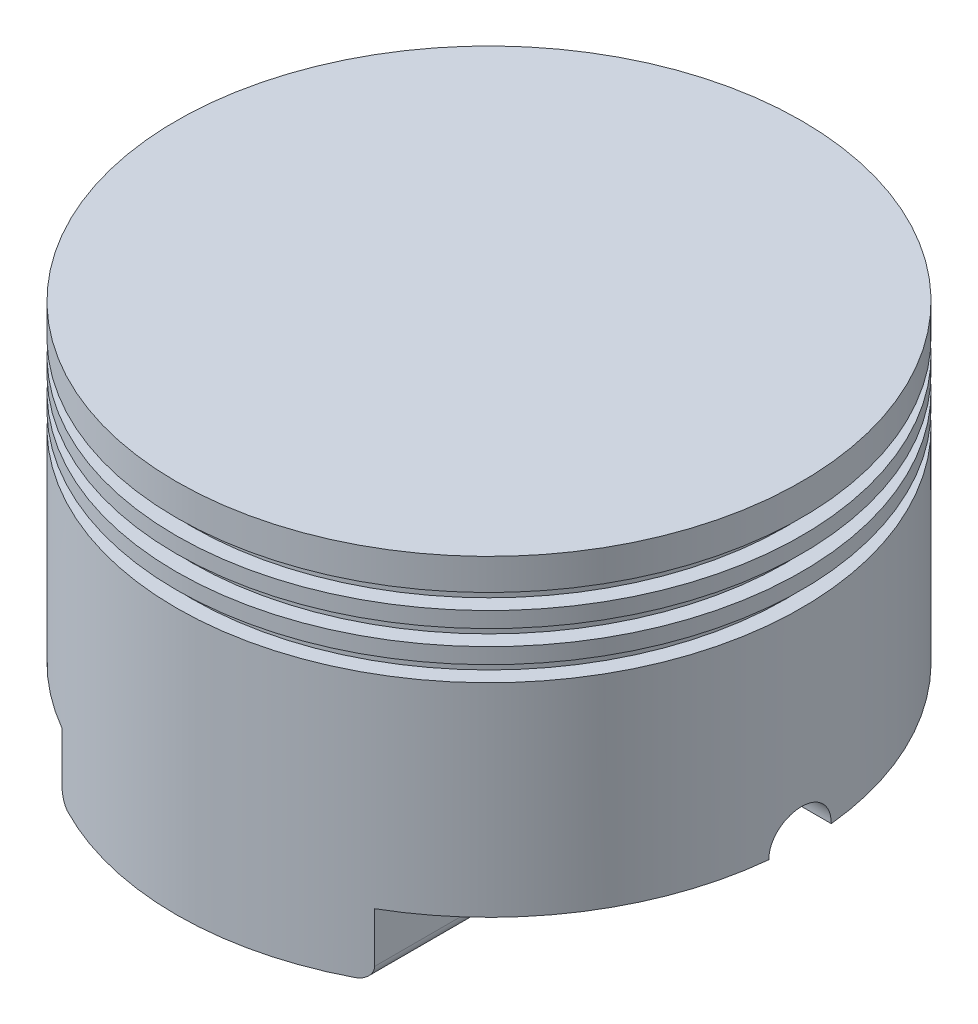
ISO-10303-21;
HEADER;
FILE_DESCRIPTION(('STEP AP214'),'2;1');
FILE_NAME('part.step','',(''),(''),'','','');
FILE_SCHEMA(('AUTOMOTIVE_DESIGN { 1 0 10303 214 1 1 1 1 }'));
ENDSEC;
DATA;
#1=APPLICATION_CONTEXT('core data for automotive mechanical design processes');
#2=APPLICATION_PROTOCOL_DEFINITION('international standard','automotive_design',2000,#1);
#3=PRODUCT_CONTEXT('',#1,'mechanical');
#4=PRODUCT('Part','Part','',(#3));
#5=PRODUCT_RELATED_PRODUCT_CATEGORY('part','',(#4));
#6=PRODUCT_DEFINITION_FORMATION('','',#4);
#7=PRODUCT_DEFINITION_CONTEXT('part definition',#1,'design');
#8=PRODUCT_DEFINITION('design','',#6,#7);
#9=PRODUCT_DEFINITION_SHAPE('','',#8);
#10=(LENGTH_UNIT() NAMED_UNIT(*) SI_UNIT(.MILLI.,.METRE.));
#11=(NAMED_UNIT(*) PLANE_ANGLE_UNIT() SI_UNIT($,.RADIAN.));
#12=(NAMED_UNIT(*) SI_UNIT($,.STERADIAN.) SOLID_ANGLE_UNIT());
#13=UNCERTAINTY_MEASURE_WITH_UNIT(LENGTH_MEASURE(1.E-05),#10,'distance_accuracy_value','');
#14=(GEOMETRIC_REPRESENTATION_CONTEXT(3) GLOBAL_UNCERTAINTY_ASSIGNED_CONTEXT((#13)) GLOBAL_UNIT_ASSIGNED_CONTEXT((#10,
#11,#12)) REPRESENTATION_CONTEXT('',''));
#15=CARTESIAN_POINT('',(0.,0.,0.));
#16=DIRECTION('',(0.,0.,1.));
#17=DIRECTION('',(1.,0.,0.));
#18=AXIS2_PLACEMENT_3D('',#15,#16,#17);
#19=CARTESIAN_POINT('',(-31.75,-25.4,0.));
#20=DIRECTION('',(1.,0.,0.));
#21=DIRECTION('',(0.,0.,-1.));
#22=AXIS2_PLACEMENT_3D('',#19,#20,#21);
#23=CYLINDRICAL_SURFACE('',#22,6.35);
#24=CARTESIAN_POINT('',(50.8,-25.4,0.));
#25=DIRECTION('',(1.,0.,0.));
#26=DIRECTION('',(0.,0.,-1.));
#27=AXIS2_PLACEMENT_3D('',#24,#25,#26);
#28=CIRCLE('',#27,6.35);
#29=CARTESIAN_POINT('',(50.8,-25.4,-6.35));
#30=VERTEX_POINT('',#29);
#31=EDGE_CURVE('E283',#30,#30,#28,.T.);
#32=ORIENTED_EDGE('',*,*,#31,.F.);
#33=EDGE_LOOP('',(#32));
#34=FACE_BOUND('',#33,.T.);
#35=CARTESIAN_POINT('',(56.896,-25.4,0.));
#36=DIRECTION('',(1.,0.,0.));
#37=DIRECTION('',(0.,0.,-1.));
#38=AXIS2_PLACEMENT_3D('',#35,#36,#37);
#39=CIRCLE('',#38,6.35);
#40=CARTESIAN_POINT('',(56.896,-25.4,-6.35));
#41=VERTEX_POINT('',#40);
#42=EDGE_CURVE('E517',#41,#41,#39,.F.);
#43=ORIENTED_EDGE('',*,*,#42,.F.);
#44=EDGE_LOOP('',(#43));
#45=FACE_BOUND('',#44,.T.);
#46=ADVANCED_FACE('F37',(#34,#45),#23,.F.);
#47=CARTESIAN_POINT('',(63.5,-25.4,-63.5));
#48=DIRECTION('',(0.,1.,0.));
#49=DIRECTION('',(-1.,0.,0.));
#50=AXIS2_PLACEMENT_3D('',#47,#48,#49);
#51=PLANE('',#50);
#52=CARTESIAN_POINT('',(31.75,-25.4,0.));
#53=DIRECTION('',(0.,1.,0.));
#54=DIRECTION('',(-1.,0.,0.));
#55=AXIS2_PLACEMENT_3D('',#52,#53,#54);
#56=CIRCLE('',#55,57.15);
#57=CARTESIAN_POINT('',(88.5461266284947,-25.4,6.35));
#58=VERTEX_POINT('',#57);
#59=CARTESIAN_POINT('',(63.5,-25.4,47.5190488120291));
#60=VERTEX_POINT('',#59);
#61=EDGE_CURVE('E279',#58,#60,#56,.F.);
#62=ORIENTED_EDGE('',*,*,#61,.F.);
#63=DIRECTION('',(1.,0.,0.));
#64=VECTOR('',#63,1.);
#65=CARTESIAN_POINT('',(-31.75,-25.4,6.35));
#66=LINE('',#65,#64);
#67=CARTESIAN_POINT('',(94.9317022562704,-25.4,6.35));
#68=VERTEX_POINT('',#67);
#69=EDGE_CURVE('E742',#58,#68,#66,.T.);
#70=ORIENTED_EDGE('',*,*,#69,.T.);
#71=CARTESIAN_POINT('',(31.75,-25.4,0.));
#72=DIRECTION('',(0.,1.,0.));
#73=DIRECTION('',(-1.,0.,0.));
#74=AXIS2_PLACEMENT_3D('',#71,#72,#73);
#75=CIRCLE('',#74,63.5);
#76=CARTESIAN_POINT('',(63.5,-25.4,54.9926131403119));
#77=VERTEX_POINT('',#76);
#78=EDGE_CURVE('E595',#77,#68,#75,.T.);
#79=ORIENTED_EDGE('',*,*,#78,.F.);
#80=DIRECTION('',(0.,0.,1.));
#81=VECTOR('',#80,1.);
#82=CARTESIAN_POINT('',(63.5,-25.4,-63.5));
#83=LINE('',#82,#81);
#84=EDGE_CURVE('E591',#60,#77,#83,.T.);
#85=ORIENTED_EDGE('',*,*,#84,.F.);
#86=EDGE_LOOP('',(#62,#70,#79,#85));
#87=FACE_BOUND('',#86,.T.);
#88=ADVANCED_FACE('F481',(#87),#51,.F.);
#89=CARTESIAN_POINT('',(0.,-25.4,-63.5));
#90=DIRECTION('',(0.,1.,0.));
#91=DIRECTION('',(0.,0.,1.));
#92=AXIS2_PLACEMENT_3D('',#89,#90,#91);
#93=PLANE('',#92);
#94=CARTESIAN_POINT('',(31.75,-25.4,0.));
#95=DIRECTION('',(0.,1.,0.));
#96=DIRECTION('',(0.,0.,1.));
#97=AXIS2_PLACEMENT_3D('',#94,#95,#96);
#98=CIRCLE('',#97,63.5);
#99=CARTESIAN_POINT('',(-31.4317022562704,-25.4,6.35));
#100=VERTEX_POINT('',#99);
#101=CARTESIAN_POINT('',(0.,-25.4,54.9926131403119));
#102=VERTEX_POINT('',#101);
#103=EDGE_CURVE('E661',#100,#102,#98,.T.);
#104=ORIENTED_EDGE('',*,*,#103,.F.);
#105=DIRECTION('',(1.,0.,0.));
#106=VECTOR('',#105,1.);
#107=CARTESIAN_POINT('',(-31.75,-25.4,6.35));
#108=LINE('',#107,#106);
#109=CARTESIAN_POINT('',(-25.0461266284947,-25.4,6.35));
#110=VERTEX_POINT('',#109);
#111=EDGE_CURVE('E269',#100,#110,#108,.T.);
#112=ORIENTED_EDGE('',*,*,#111,.T.);
#113=CARTESIAN_POINT('',(31.75,-25.4,0.));
#114=DIRECTION('',(0.,1.,0.));
#115=DIRECTION('',(0.,0.,1.));
#116=AXIS2_PLACEMENT_3D('',#113,#114,#115);
#117=CIRCLE('',#116,57.15);
#118=CARTESIAN_POINT('',(0.,-25.4,47.5190488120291));
#119=VERTEX_POINT('',#118);
#120=EDGE_CURVE('E268',#119,#110,#117,.F.);
#121=ORIENTED_EDGE('',*,*,#120,.F.);
#122=DIRECTION('',(0.,0.,1.));
#123=VECTOR('',#122,1.);
#124=CARTESIAN_POINT('',(0.,-25.4,-63.5));
#125=LINE('',#124,#123);
#126=EDGE_CURVE('E672',#119,#102,#125,.T.);
#127=ORIENTED_EDGE('',*,*,#126,.T.);
#128=EDGE_LOOP('',(#104,#112,#121,#127));
#129=FACE_BOUND('',#128,.T.);
#130=ADVANCED_FACE('F487',(#129),#93,.F.);
#131=CARTESIAN_POINT('',(31.75,12.7,0.));
#132=DIRECTION('',(0.,-1.,0.));
#133=DIRECTION('',(0.,0.,-1.));
#134=AXIS2_PLACEMENT_3D('',#131,#132,#133);
#135=CYLINDRICAL_SURFACE('',#134,57.15);
#136=CARTESIAN_POINT('',(31.75,-38.1,0.));
#137=DIRECTION('',(0.,-1.,0.));
#138=DIRECTION('',(0.,0.,-1.));
#139=AXIS2_PLACEMENT_3D('',#136,#137,#138);
#140=CIRCLE('',#139,57.15);
#141=CARTESIAN_POINT('',(3.81000000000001,-38.1,-49.8545775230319));
#142=VERTEX_POINT('',#141);
#143=CARTESIAN_POINT('',(59.69,-38.1,-49.8545775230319));
#144=VERTEX_POINT('',#143);
#145=EDGE_CURVE('E651',#142,#144,#140,.T.);
#146=ORIENTED_EDGE('',*,*,#145,.T.);
#147=CARTESIAN_POINT('',(59.69,-38.1,-49.8545775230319));
#148=CARTESIAN_POINT('',(59.5335045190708,-38.1000464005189,-49.9423212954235));
#149=CARTESIAN_POINT('',(59.3764090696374,-38.0855281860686,-50.029355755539));
#150=CARTESIAN_POINT('',(59.0649721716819,-38.0270057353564,-50.2000541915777));
#151=CARTESIAN_POINT('',(58.9106470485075,-37.9828638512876,-50.2837004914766));
#152=CARTESIAN_POINT('',(58.6098657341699,-37.8645780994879,-50.4450153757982));
#153=CARTESIAN_POINT('',(58.4634311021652,-37.7903563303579,-50.5226678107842));
#154=CARTESIAN_POINT('',(58.1848225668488,-37.6126288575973,-50.6689975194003));
#155=CARTESIAN_POINT('',(58.0526214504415,-37.509180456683,-50.7376919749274));
#156=CARTESIAN_POINT('',(57.819463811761,-37.2852143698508,-50.8578533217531));
#157=CARTESIAN_POINT('',(57.7167663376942,-37.1670697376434,-50.9103141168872));
#158=CARTESIAN_POINT('',(57.5791957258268,-36.975041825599,-50.9801707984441));
#159=CARTESIAN_POINT('',(57.5360666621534,-36.9085255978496,-51.0019929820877));
#160=CARTESIAN_POINT('',(57.4558589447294,-36.7710062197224,-51.0424659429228));
#161=CARTESIAN_POINT('',(57.4187792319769,-36.700003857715,-51.0611172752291));
#162=CARTESIAN_POINT('',(57.3553574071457,-36.5630119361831,-51.0929474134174));
#163=CARTESIAN_POINT('',(57.3282580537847,-36.4974614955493,-51.1065157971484));
#164=CARTESIAN_POINT('',(57.2795127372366,-36.3638679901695,-51.1308832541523));
#165=CARTESIAN_POINT('',(57.257865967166,-36.2958252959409,-51.1416827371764));
#166=CARTESIAN_POINT('',(57.2203481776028,-36.1579270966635,-51.1603782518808));
#167=CARTESIAN_POINT('',(57.2044656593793,-36.0880755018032,-51.1682800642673));
#168=CARTESIAN_POINT('',(57.1786403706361,-35.9470478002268,-51.1811191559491));
#169=CARTESIAN_POINT('',(57.1686938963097,-35.8758725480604,-51.1860582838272));
#170=CARTESIAN_POINT('',(57.1578561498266,-35.7637481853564,-51.1914383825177));
#171=CARTESIAN_POINT('',(57.1549091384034,-35.7230341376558,-51.1929008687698));
#172=CARTESIAN_POINT('',(57.150982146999,-35.6415486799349,-51.1948494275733));
#173=CARTESIAN_POINT('',(57.1499992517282,-35.6007774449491,-51.1953369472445));
#174=CARTESIAN_POINT('',(57.15,-35.56,-51.1953367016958));
#175=B_SPLINE_CURVE_WITH_KNOTS('',3,(#147,#148,#149,#150,#151,#152,#153,#154,#155,#156,#157,
#158,#159,#160,#161,#162,#163,#164,#165,#166,#167,#168,#169,#170,#171,#172,#173,#174),
.UNSPECIFIED.,.F.,.F.,(4,2,2,2,2,2,2,2,2,2,2,2,2,4),(0.,0.537940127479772,1.07839728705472,
1.62026316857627,2.16107393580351,2.65322861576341,2.89956215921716,3.14585253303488,
3.36221822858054,3.5785518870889,3.79445159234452,4.01021644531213,4.13270368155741,
4.25500897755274),.UNSPECIFIED.);
#176=CARTESIAN_POINT('',(57.15,-35.56,-51.1953367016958));
#177=VERTEX_POINT('',#176);
#178=EDGE_CURVE('E451',#144,#177,#175,.T.);
#179=ORIENTED_EDGE('',*,*,#178,.T.);
#180=DIRECTION('',(0.,1.,0.));
#181=VECTOR('',#180,1.);
#182=CARTESIAN_POINT('',(57.15,-141.275287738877,-51.1953367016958));
#183=LINE('',#182,#181);
#184=CARTESIAN_POINT('',(57.15,12.7,-51.1953367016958));
#185=VERTEX_POINT('',#184);
#186=EDGE_CURVE('E715',#177,#185,#183,.T.);
#187=ORIENTED_EDGE('',*,*,#186,.T.);
#188=CARTESIAN_POINT('',(31.75,12.7,0.));
#189=DIRECTION('',(0.,-1.,0.));
#190=DIRECTION('',(0.,0.,-1.));
#191=AXIS2_PLACEMENT_3D('',#188,#189,#190);
#192=CIRCLE('',#191,57.15);
#193=CARTESIAN_POINT('',(6.35000000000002,12.7,-51.1953367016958));
#194=VERTEX_POINT('',#193);
#195=EDGE_CURVE('E655',#194,#185,#192,.T.);
#196=ORIENTED_EDGE('',*,*,#195,.F.);
#197=DIRECTION('',(0.,1.,0.));
#198=VECTOR('',#197,1.);
#199=CARTESIAN_POINT('',(6.35000000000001,-141.275287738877,-51.1953367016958));
#200=LINE('',#199,#198);
#201=CARTESIAN_POINT('',(6.35000000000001,-35.56,-51.1953367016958));
#202=VERTEX_POINT('',#201);
#203=EDGE_CURVE('E676',#202,#194,#200,.T.);
#204=ORIENTED_EDGE('',*,*,#203,.F.);
#205=CARTESIAN_POINT('',(6.35000000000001,-35.56,-51.1953367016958));
#206=CARTESIAN_POINT('',(6.35001016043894,-35.625935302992,-51.1953407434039));
#207=CARTESIAN_POINT('',(6.34743282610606,-35.691865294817,-51.1940630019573));
#208=CARTESIAN_POINT('',(6.33718093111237,-35.8232138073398,-51.1889752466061));
#209=CARTESIAN_POINT('',(6.32950761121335,-35.8886324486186,-51.1851658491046));
#210=CARTESIAN_POINT('',(6.3091754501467,-36.018273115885,-51.175062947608));
#211=CARTESIAN_POINT('',(6.29653334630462,-36.0824984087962,-51.1687777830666));
#212=CARTESIAN_POINT('',(6.26642268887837,-36.2095022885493,-51.1537884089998));
#213=CARTESIAN_POINT('',(6.2489540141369,-36.2722808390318,-51.1450841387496));
#214=CARTESIAN_POINT('',(6.18959457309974,-36.4577337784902,-51.1154590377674));
#215=CARTESIAN_POINT('',(6.14072170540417,-36.5777049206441,-51.091011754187));
#216=CARTESIAN_POINT('',(6.02642757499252,-36.8072086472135,-51.0335613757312));
#217=CARTESIAN_POINT('',(5.96099688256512,-36.9167352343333,-51.0005534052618));
#218=CARTESIAN_POINT('',(5.81321934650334,-37.1271167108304,-50.9255634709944));
#219=CARTESIAN_POINT('',(5.7303188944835,-37.2274763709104,-50.8832853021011));
#220=CARTESIAN_POINT('',(5.55217373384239,-37.4128286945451,-50.791794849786));
#221=CARTESIAN_POINT('',(5.45692700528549,-37.4978188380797,-50.7425814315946));
#222=CARTESIAN_POINT('',(5.24703875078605,-37.6589753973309,-50.6332977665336));
#223=CARTESIAN_POINT('',(5.13141109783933,-37.7334540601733,-50.5726358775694));
#224=CARTESIAN_POINT('',(4.8919788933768,-37.862047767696,-50.445888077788));
#225=CARTESIAN_POINT('',(4.76816539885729,-37.9161400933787,-50.3797962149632));
#226=CARTESIAN_POINT('',(4.50656211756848,-38.00681382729,-50.2388397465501));
#227=CARTESIAN_POINT('',(4.36840454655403,-38.0418765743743,-50.1636855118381));
#228=CARTESIAN_POINT('',(4.09000778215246,-38.0884592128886,-50.0107305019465));
#229=CARTESIAN_POINT('',(3.94977405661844,-38.1000326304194,-49.9329361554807));
#230=CARTESIAN_POINT('',(3.81000000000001,-38.1,-49.8545775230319));
#231=B_SPLINE_CURVE_WITH_KNOTS('',3,(#205,#206,#207,#208,#209,#210,#211,#212,#213,#214,#215,
#216,#217,#218,#219,#220,#221,#222,#223,#224,#225,#226,#227,#228,#229,#230),.UNSPECIFIED.,.F.,
.F.,(4,2,2,2,2,2,2,2,2,2,2,2,4),(0.,0.197734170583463,0.39542021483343,0.59244598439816,
0.789476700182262,1.18299819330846,1.57674430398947,1.98562714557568,2.3945769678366,
2.84371262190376,3.29334733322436,3.77495440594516,4.25546278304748),.UNSPECIFIED.);
#232=EDGE_CURVE('E47',#202,#142,#231,.T.);
#233=ORIENTED_EDGE('',*,*,#232,.T.);
#234=EDGE_LOOP('',(#146,#179,#187,#196,#204,#233));
#235=FACE_BOUND('',#234,.T.);
#236=ADVANCED_FACE('F423',(#235),#135,.F.);
#237=CARTESIAN_POINT('',(63.5,-25.4,-47.5190488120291));
#238=VERTEX_POINT('',#237);
#239=CARTESIAN_POINT('',(88.5461266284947,-25.4,-6.35));
#240=VERTEX_POINT('',#239);
#241=EDGE_CURVE('E275',#238,#240,#56,.F.);
#242=ORIENTED_EDGE('',*,*,#241,.T.);
#243=CARTESIAN_POINT('',(88.5461266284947,-25.4,-6.35));
#244=CARTESIAN_POINT('',(88.546118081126,-25.2219902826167,-6.35001981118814));
#245=CARTESIAN_POINT('',(88.546963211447,-25.0439841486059,-6.34251561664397));
#246=CARTESIAN_POINT('',(88.5502989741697,-24.6892562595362,-6.31260287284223));
#247=CARTESIAN_POINT('',(88.5527894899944,-24.512534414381,-6.29019537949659));
#248=CARTESIAN_POINT('',(88.5593510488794,-24.1617944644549,-6.230648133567));
#249=CARTESIAN_POINT('',(88.563420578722,-23.9877739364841,-6.19352248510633));
#250=CARTESIAN_POINT('',(88.5730208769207,-23.6434997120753,-6.10481778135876));
#251=CARTESIAN_POINT('',(88.5785516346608,-23.473245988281,-6.05323883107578));
#252=CARTESIAN_POINT('',(88.5909181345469,-23.1376780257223,-5.93599143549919));
#253=CARTESIAN_POINT('',(88.5977540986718,-22.9723646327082,-5.87032059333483));
#254=CARTESIAN_POINT('',(88.6125383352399,-22.6478085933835,-5.72534215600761));
#255=CARTESIAN_POINT('',(88.620487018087,-22.4885682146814,-5.64602952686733));
#256=CARTESIAN_POINT('',(88.6372653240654,-22.1774104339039,-5.47439232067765));
#257=CARTESIAN_POINT('',(88.6460945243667,-22.0254895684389,-5.38207398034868));
#258=CARTESIAN_POINT('',(88.6643912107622,-21.7298909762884,-5.18501344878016));
#259=CARTESIAN_POINT('',(88.6738589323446,-21.5862163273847,-5.08026666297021));
#260=CARTESIAN_POINT('',(88.693197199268,-21.3076801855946,-4.85872362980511));
#261=CARTESIAN_POINT('',(88.7030690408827,-21.1728513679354,-4.74188641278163));
#262=CARTESIAN_POINT('',(88.7229089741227,-20.9134544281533,-4.49724413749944));
#263=CARTESIAN_POINT('',(88.7328770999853,-20.7888901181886,-4.36943504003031));
#264=CARTESIAN_POINT('',(88.7526225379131,-20.550976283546,-4.10380945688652));
#265=CARTESIAN_POINT('',(88.7623998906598,-20.437624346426,-3.96599513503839));
#266=CARTESIAN_POINT('',(88.7814939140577,-20.22286313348,-3.68124527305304));
#267=CARTESIAN_POINT('',(88.7908104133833,-20.1214582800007,-3.53430638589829));
#268=CARTESIAN_POINT('',(88.8087358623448,-19.9311485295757,-3.23204711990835));
#269=CARTESIAN_POINT('',(88.817343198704,-19.8422718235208,-3.07670889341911));
#270=CARTESIAN_POINT('',(88.8335860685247,-19.6778942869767,-2.75898707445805));
#271=CARTESIAN_POINT('',(88.8412212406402,-19.6023984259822,-2.59660089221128));
#272=CARTESIAN_POINT('',(88.8552957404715,-19.4654026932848,-2.26606395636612));
#273=CARTESIAN_POINT('',(88.8617356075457,-19.403896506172,-2.09791584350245));
#274=CARTESIAN_POINT('',(88.8732425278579,-19.2952675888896,-1.75692143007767));
#275=CARTESIAN_POINT('',(88.8783090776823,-19.2481501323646,-1.58407343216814));
#276=CARTESIAN_POINT('',(88.8869029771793,-19.1688499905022,-1.2357341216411));
#277=CARTESIAN_POINT('',(88.8904368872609,-19.1366036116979,-1.06025746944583));
#278=CARTESIAN_POINT('',(88.8958971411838,-19.0869841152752,-0.707185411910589));
#279=CARTESIAN_POINT('',(88.8978234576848,-19.0696112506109,-0.529589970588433));
#280=CARTESIAN_POINT('',(88.9000137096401,-19.0498689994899,-0.173559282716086));
#281=CARTESIAN_POINT('',(88.9002776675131,-19.0474994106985,0.00487595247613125));
#282=CARTESIAN_POINT('',(88.8991357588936,-19.0577808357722,0.361307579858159));
#283=CARTESIAN_POINT('',(88.8977298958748,-19.0704318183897,0.539303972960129));
#284=CARTESIAN_POINT('',(88.8932981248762,-19.1105711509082,0.892797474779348));
#285=CARTESIAN_POINT('',(88.8902794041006,-19.1379936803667,1.06830215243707));
#286=CARTESIAN_POINT('',(88.8827114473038,-19.2074313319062,1.416363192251));
#287=CARTESIAN_POINT('',(88.8781622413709,-19.2494461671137,1.58891961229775));
#288=CARTESIAN_POINT('',(88.8676599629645,-19.3477717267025,1.92990247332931));
#289=CARTESIAN_POINT('',(88.8617066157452,-19.4040852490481,2.09832809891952));
#290=CARTESIAN_POINT('',(88.8485657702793,-19.5305736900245,2.42977100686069));
#291=CARTESIAN_POINT('',(88.8413787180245,-19.6007436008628,2.59279021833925));
#292=CARTESIAN_POINT('',(88.8259502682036,-19.7546503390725,2.91275174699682));
#293=CARTESIAN_POINT('',(88.8177062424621,-19.8384211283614,3.06967760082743));
#294=CARTESIAN_POINT('',(88.8004124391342,-20.0187724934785,3.37586260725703));
#295=CARTESIAN_POINT('',(88.7913629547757,-20.1153484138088,3.5251245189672));
#296=CARTESIAN_POINT('',(88.7727055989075,-20.3206883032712,3.81505702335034));
#297=CARTESIAN_POINT('',(88.7630975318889,-20.4294565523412,3.95572457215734));
#298=CARTESIAN_POINT('',(88.7435983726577,-20.6583495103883,4.22738540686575));
#299=CARTESIAN_POINT('',(88.7337073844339,-20.7784700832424,4.35838218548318));
#300=CARTESIAN_POINT('',(88.7138598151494,-21.0299743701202,4.61056033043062));
#301=CARTESIAN_POINT('',(88.7039031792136,-21.1614178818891,4.73168206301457));
#302=CARTESIAN_POINT('',(88.6842659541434,-21.4340060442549,4.96238475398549));
#303=CARTESIAN_POINT('',(88.6745852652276,-21.5751471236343,5.07196992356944));
#304=CARTESIAN_POINT('',(88.6557646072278,-21.8662829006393,5.2789453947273));
#305=CARTESIAN_POINT('',(88.6466250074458,-22.0162835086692,5.37632741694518));
#306=CARTESIAN_POINT('',(88.6291576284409,-22.3239398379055,5.55808091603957));
#307=CARTESIAN_POINT('',(88.6208295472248,-22.4815926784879,5.64245723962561));
#308=CARTESIAN_POINT('',(88.6052098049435,-22.8036972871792,5.79773389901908));
#309=CARTESIAN_POINT('',(88.59791946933,-22.9681574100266,5.86861703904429));
#310=CARTESIAN_POINT('',(88.5846003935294,-23.3024582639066,5.99623347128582));
#311=CARTESIAN_POINT('',(88.578571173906,-23.4722969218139,6.05297214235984));
#312=CARTESIAN_POINT('',(88.5679509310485,-23.8160102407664,6.15186351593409));
#313=CARTESIAN_POINT('',(88.5633583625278,-23.9898803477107,6.19403189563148));
#314=CARTESIAN_POINT('',(88.555737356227,-24.3405221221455,6.26353961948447));
#315=CARTESIAN_POINT('',(88.5527081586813,-24.517292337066,6.29088616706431));
#316=CARTESIAN_POINT('',(88.5490492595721,-24.812016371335,6.32381797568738));
#317=CARTESIAN_POINT('',(88.5479537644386,-24.9295076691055,6.33364211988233));
#318=CARTESIAN_POINT('',(88.5464923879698,-25.1646620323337,6.34672867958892));
#319=CARTESIAN_POINT('',(88.5461252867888,-25.2823244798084,6.35000206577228));
#320=CARTESIAN_POINT('',(88.5461266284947,-25.4,6.35));
#321=B_SPLINE_CURVE_WITH_KNOTS('',3,(#243,#244,#245,#246,#247,#248,#249,#250,#251,#252,#253,
#254,#255,#256,#257,#258,#259,#260,#261,#262,#263,#264,#265,#266,#267,#268,#269,#270,#271,#272,
#273,#274,#275,#276,#277,#278,#279,#280,#281,#282,#283,#284,#285,#286,#287,#288,#289,#290,#291,
#292,#293,#294,#295,#296,#297,#298,#299,#300,#301,#302,#303,#304,#305,#306,#307,#308,#309,#310,
#311,#312,#313,#314,#315,#316,#317,#318,#319,#320),.UNSPECIFIED.,.F.,.F.,(4,2,2,2,2,2,2,2,2,2,2,
2,2,2,2,2,2,2,2,2,2,2,2,2,2,2,2,2,2,2,2,2,2,2,2,2,2,2,4),(0.,0.53386383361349,1.06768984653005,
1.6010055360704,2.13431735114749,2.66771994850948,3.20131980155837,3.7346646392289,
4.26820726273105,4.80362104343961,5.33923278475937,5.87472903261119,6.41042288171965,
6.94730353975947,7.48438317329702,8.021219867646,8.55825308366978,9.09296429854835,
9.62768460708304,10.1623977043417,10.6971096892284,11.2294585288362,11.7617969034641,
12.2942395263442,12.8264900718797,13.3600907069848,13.893497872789,14.4270928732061,
14.9604942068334,15.4969090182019,16.0331273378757,16.5697075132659,17.106087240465,
17.6431460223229,18.1800002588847,18.7162750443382,19.2522889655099,19.6058361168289,
19.9587906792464),.UNSPECIFIED.);
#322=EDGE_CURVE('E437',#240,#58,#321,.T.);
#323=ORIENTED_EDGE('',*,*,#322,.T.);
#324=ORIENTED_EDGE('',*,*,#61,.T.);
#325=DIRECTION('',(0.,1.,0.));
#326=VECTOR('',#325,1.);
#327=CARTESIAN_POINT('',(63.5,-141.275287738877,47.5190488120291));
#328=LINE('',#327,#326);
#329=CARTESIAN_POINT('',(63.5,12.7,47.5190488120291));
#330=VERTEX_POINT('',#329);
#331=EDGE_CURVE('E720',#60,#330,#328,.T.);
#332=ORIENTED_EDGE('',*,*,#331,.T.);
#333=CARTESIAN_POINT('',(63.5,12.7,-47.5190488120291));
#334=VERTEX_POINT('',#333);
#335=EDGE_CURVE('E658',#334,#330,#192,.T.);
#336=ORIENTED_EDGE('',*,*,#335,.F.);
#337=DIRECTION('',(0.,1.,0.));
#338=VECTOR('',#337,1.);
#339=CARTESIAN_POINT('',(63.5,-141.275287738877,-47.5190488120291));
#340=LINE('',#339,#338);
#341=EDGE_CURVE('E717',#238,#334,#340,.T.);
#342=ORIENTED_EDGE('',*,*,#341,.F.);
#343=EDGE_LOOP('',(#242,#323,#324,#332,#336,#342));
#344=FACE_BOUND('',#343,.T.);
#345=ADVANCED_FACE('F763',(#344),#135,.F.);
#346=CARTESIAN_POINT('',(31.75,12.7,0.));
#347=DIRECTION('',(0.,-1.,0.));
#348=DIRECTION('',(0.,0.,-1.));
#349=AXIS2_PLACEMENT_3D('',#346,#347,#348);
#350=PLANE('',#349);
#351=ORIENTED_EDGE('',*,*,#195,.T.);
#352=DIRECTION('',(0.,0.,-1.));
#353=VECTOR('',#352,1.);
#354=CARTESIAN_POINT('',(57.15,12.7,0.));
#355=LINE('',#354,#353);
#356=CARTESIAN_POINT('',(57.15,12.7,-25.4));
#357=VERTEX_POINT('',#356);
#358=EDGE_CURVE('E731',#357,#185,#355,.T.);
#359=ORIENTED_EDGE('',*,*,#358,.F.);
#360=DIRECTION('',(1.,0.,0.));
#361=VECTOR('',#360,1.);
#362=CARTESIAN_POINT('',(0.,12.7,-25.4));
#363=LINE('',#362,#361);
#364=CARTESIAN_POINT('',(50.8,12.7,-25.4));
#365=VERTEX_POINT('',#364);
#366=EDGE_CURVE('E734',#365,#357,#363,.T.);
#367=ORIENTED_EDGE('',*,*,#366,.F.);
#368=DIRECTION('',(0.,0.,-1.));
#369=VECTOR('',#368,1.);
#370=CARTESIAN_POINT('',(50.8,12.7,0.));
#371=LINE('',#370,#369);
#372=CARTESIAN_POINT('',(50.8,12.7,25.4));
#373=VERTEX_POINT('',#372);
#374=EDGE_CURVE('E737',#373,#365,#371,.T.);
#375=ORIENTED_EDGE('',*,*,#374,.F.);
#376=DIRECTION('',(1.,0.,0.));
#377=VECTOR('',#376,1.);
#378=CARTESIAN_POINT('',(0.,12.7,25.4));
#379=LINE('',#378,#377);
#380=CARTESIAN_POINT('',(57.15,12.7,25.4));
#381=VERTEX_POINT('',#380);
#382=EDGE_CURVE('E740',#373,#381,#379,.T.);
#383=ORIENTED_EDGE('',*,*,#382,.T.);
#384=DIRECTION('',(0.,0.,1.));
#385=VECTOR('',#384,1.);
#386=CARTESIAN_POINT('',(57.15,12.7,0.));
#387=LINE('',#386,#385);
#388=CARTESIAN_POINT('',(57.15,12.7,51.1953367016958));
#389=VERTEX_POINT('',#388);
#390=EDGE_CURVE('E726',#381,#389,#387,.T.);
#391=ORIENTED_EDGE('',*,*,#390,.T.);
#392=CARTESIAN_POINT('',(6.35,12.7,51.1953367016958));
#393=VERTEX_POINT('',#392);
#394=EDGE_CURVE('E659',#389,#393,#192,.T.);
#395=ORIENTED_EDGE('',*,*,#394,.T.);
#396=DIRECTION('',(0.,0.,1.));
#397=VECTOR('',#396,1.);
#398=CARTESIAN_POINT('',(6.35,12.7,0.));
#399=LINE('',#398,#397);
#400=CARTESIAN_POINT('',(6.35,12.7,25.4));
#401=VERTEX_POINT('',#400);
#402=EDGE_CURVE('E691',#401,#393,#399,.T.);
#403=ORIENTED_EDGE('',*,*,#402,.F.);
#404=DIRECTION('',(-1.,0.,0.));
#405=VECTOR('',#404,1.);
#406=CARTESIAN_POINT('',(0.,12.7,25.4));
#407=LINE('',#406,#405);
#408=CARTESIAN_POINT('',(12.7,12.7,25.4));
#409=VERTEX_POINT('',#408);
#410=EDGE_CURVE('E694',#409,#401,#407,.T.);
#411=ORIENTED_EDGE('',*,*,#410,.F.);
#412=DIRECTION('',(0.,0.,-1.));
#413=VECTOR('',#412,1.);
#414=CARTESIAN_POINT('',(12.7,12.7,0.));
#415=LINE('',#414,#413);
#416=CARTESIAN_POINT('',(12.7,12.7,-25.4));
#417=VERTEX_POINT('',#416);
#418=EDGE_CURVE('E697',#409,#417,#415,.T.);
#419=ORIENTED_EDGE('',*,*,#418,.T.);
#420=DIRECTION('',(-1.,0.,0.));
#421=VECTOR('',#420,1.);
#422=CARTESIAN_POINT('',(0.,12.7,-25.4));
#423=LINE('',#422,#421);
#424=CARTESIAN_POINT('',(6.35000000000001,12.7,-25.4));
#425=VERTEX_POINT('',#424);
#426=EDGE_CURVE('E700',#417,#425,#423,.T.);
#427=ORIENTED_EDGE('',*,*,#426,.T.);
#428=DIRECTION('',(0.,0.,-1.));
#429=VECTOR('',#428,1.);
#430=CARTESIAN_POINT('',(6.35,12.7,0.));
#431=LINE('',#430,#429);
#432=EDGE_CURVE('E703',#425,#194,#431,.T.);
#433=ORIENTED_EDGE('',*,*,#432,.T.);
#434=EDGE_LOOP('',(#351,#359,#367,#375,#383,#391,#395,#403,#411,#419,#427,#433));
#435=FACE_BOUND('',#434,.T.);
#436=ADVANCED_FACE('F421',(#435),#350,.T.);
#437=ORIENTED_EDGE('',*,*,#394,.F.);
#438=DIRECTION('',(0.,1.,0.));
#439=VECTOR('',#438,1.);
#440=CARTESIAN_POINT('',(57.15,-141.275287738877,51.1953367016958));
#441=LINE('',#440,#439);
#442=CARTESIAN_POINT('',(57.15,-35.56,51.1953367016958));
#443=VERTEX_POINT('',#442);
#444=EDGE_CURVE('E722',#443,#389,#441,.T.);
#445=ORIENTED_EDGE('',*,*,#444,.F.);
#446=CARTESIAN_POINT('',(57.15,-35.56,51.1953367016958));
#447=CARTESIAN_POINT('',(57.1499898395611,-35.625935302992,51.1953407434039));
#448=CARTESIAN_POINT('',(57.1525671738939,-35.691865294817,51.1940630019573));
#449=CARTESIAN_POINT('',(57.1628190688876,-35.8232138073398,51.1889752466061));
#450=CARTESIAN_POINT('',(57.1704923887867,-35.8886324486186,51.1851658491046));
#451=CARTESIAN_POINT('',(57.1908245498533,-36.018273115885,51.175062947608));
#452=CARTESIAN_POINT('',(57.2034666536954,-36.0824984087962,51.1687777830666));
#453=CARTESIAN_POINT('',(57.2335773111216,-36.2095022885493,51.1537884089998));
#454=CARTESIAN_POINT('',(57.2510459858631,-36.2722808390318,51.1450841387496));
#455=CARTESIAN_POINT('',(57.3104054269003,-36.4577337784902,51.1154590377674));
#456=CARTESIAN_POINT('',(57.3592782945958,-36.5777049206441,51.091011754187));
#457=CARTESIAN_POINT('',(57.4735724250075,-36.8072086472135,51.0335613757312));
#458=CARTESIAN_POINT('',(57.5390031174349,-36.9167352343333,51.0005534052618));
#459=CARTESIAN_POINT('',(57.6867806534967,-37.1271167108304,50.9255634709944));
#460=CARTESIAN_POINT('',(57.7696811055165,-37.2274763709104,50.8832853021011));
#461=CARTESIAN_POINT('',(57.9478262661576,-37.4128286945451,50.791794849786));
#462=CARTESIAN_POINT('',(58.0430729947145,-37.4978188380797,50.7425814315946));
#463=CARTESIAN_POINT('',(58.2529612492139,-37.6589753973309,50.6332977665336));
#464=CARTESIAN_POINT('',(58.3685889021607,-37.7334540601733,50.5726358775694));
#465=CARTESIAN_POINT('',(58.6080211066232,-37.862047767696,50.4458880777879));
#466=CARTESIAN_POINT('',(58.7318346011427,-37.9161400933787,50.3797962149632));
#467=CARTESIAN_POINT('',(58.9934378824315,-38.00681382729,50.2388397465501));
#468=CARTESIAN_POINT('',(59.131595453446,-38.0418765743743,50.1636855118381));
#469=CARTESIAN_POINT('',(59.4099922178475,-38.0884592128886,50.0107305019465));
#470=CARTESIAN_POINT('',(59.5502259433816,-38.1000326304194,49.9329361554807));
#471=CARTESIAN_POINT('',(59.69,-38.1,49.8545775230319));
#472=B_SPLINE_CURVE_WITH_KNOTS('',3,(#446,#447,#448,#449,#450,#451,#452,#453,#454,#455,#456,
#457,#458,#459,#460,#461,#462,#463,#464,#465,#466,#467,#468,#469,#470,#471),.UNSPECIFIED.,.F.,
.F.,(4,2,2,2,2,2,2,2,2,2,2,2,4),(0.,0.197734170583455,0.395420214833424,0.592445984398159,
0.789476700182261,1.18299819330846,1.57674430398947,1.98562714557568,2.3945769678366,
2.84371262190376,3.29334733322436,3.77495440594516,4.25546278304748),.UNSPECIFIED.);
#473=CARTESIAN_POINT('',(59.69,-38.1,49.8545775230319));
#474=VERTEX_POINT('',#473);
#475=EDGE_CURVE('E445',#443,#474,#472,.T.);
#476=ORIENTED_EDGE('',*,*,#475,.T.);
#477=CARTESIAN_POINT('',(3.81,-38.1,49.8545775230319));
#478=VERTEX_POINT('',#477);
#479=EDGE_CURVE('E653',#474,#478,#140,.T.);
#480=ORIENTED_EDGE('',*,*,#479,.T.);
#481=CARTESIAN_POINT('',(3.81,-38.1,49.8545775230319));
#482=CARTESIAN_POINT('',(3.96649548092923,-38.1000464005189,49.9423212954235));
#483=CARTESIAN_POINT('',(4.12359093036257,-38.0855281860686,50.029355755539));
#484=CARTESIAN_POINT('',(4.43502782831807,-38.0270057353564,50.2000541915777));
#485=CARTESIAN_POINT('',(4.58935295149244,-37.9828638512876,50.2837004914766));
#486=CARTESIAN_POINT('',(4.89013426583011,-37.8645780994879,50.4450153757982));
#487=CARTESIAN_POINT('',(5.03656889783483,-37.7903563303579,50.5226678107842));
#488=CARTESIAN_POINT('',(5.31517743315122,-37.6126288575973,50.6689975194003));
#489=CARTESIAN_POINT('',(5.44737854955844,-37.509180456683,50.7376919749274));
#490=CARTESIAN_POINT('',(5.68053618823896,-37.2852143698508,50.8578533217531));
#491=CARTESIAN_POINT('',(5.78323366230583,-37.1670697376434,50.9103141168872));
#492=CARTESIAN_POINT('',(5.92080427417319,-36.975041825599,50.9801707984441));
#493=CARTESIAN_POINT('',(5.96393333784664,-36.9085255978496,51.0019929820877));
#494=CARTESIAN_POINT('',(6.04414105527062,-36.7710062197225,51.0424659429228));
#495=CARTESIAN_POINT('',(6.08122076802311,-36.700003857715,51.0611172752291));
#496=CARTESIAN_POINT('',(6.1446425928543,-36.5630119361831,51.0929474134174));
#497=CARTESIAN_POINT('',(6.17174194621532,-36.4974614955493,51.1065157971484));
#498=CARTESIAN_POINT('',(6.22048726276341,-36.3638679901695,51.1308832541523));
#499=CARTESIAN_POINT('',(6.24213403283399,-36.2958252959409,51.1416827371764));
#500=CARTESIAN_POINT('',(6.27965182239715,-36.1579270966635,51.1603782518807));
#501=CARTESIAN_POINT('',(6.29553434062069,-36.0880755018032,51.1682800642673));
#502=CARTESIAN_POINT('',(6.32135962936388,-35.9470478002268,51.1811191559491));
#503=CARTESIAN_POINT('',(6.3313061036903,-35.8758725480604,51.1860582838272));
#504=CARTESIAN_POINT('',(6.34214385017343,-35.7637481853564,51.1914383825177));
#505=CARTESIAN_POINT('',(6.34509086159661,-35.7230341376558,51.1929008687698));
#506=CARTESIAN_POINT('',(6.34901785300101,-35.6415486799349,51.1948494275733));
#507=CARTESIAN_POINT('',(6.35000074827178,-35.6007774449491,51.1953369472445));
#508=CARTESIAN_POINT('',(6.35,-35.56,51.1953367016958));
#509=B_SPLINE_CURVE_WITH_KNOTS('',3,(#481,#482,#483,#484,#485,#486,#487,#488,#489,#490,#491,
#492,#493,#494,#495,#496,#497,#498,#499,#500,#501,#502,#503,#504,#505,#506,#507,#508),
.UNSPECIFIED.,.F.,.F.,(4,2,2,2,2,2,2,2,2,2,2,2,2,4),(0.,0.537940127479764,1.07839728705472,
1.62026316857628,2.1610739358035,2.6532286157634,2.89956215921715,3.14585253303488,
3.36221822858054,3.57855188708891,3.79445159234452,4.01021644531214,4.13270368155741,
4.25500897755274),.UNSPECIFIED.);
#510=CARTESIAN_POINT('',(6.35,-35.56,51.1953367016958));
#511=VERTEX_POINT('',#510);
#512=EDGE_CURVE('E12',#478,#511,#509,.T.);
#513=ORIENTED_EDGE('',*,*,#512,.T.);
#514=DIRECTION('',(0.,1.,0.));
#515=VECTOR('',#514,1.);
#516=CARTESIAN_POINT('',(6.35,-141.275287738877,51.1953367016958));
#517=LINE('',#516,#515);
#518=EDGE_CURVE('E686',#511,#393,#517,.T.);
#519=ORIENTED_EDGE('',*,*,#518,.T.);
#520=EDGE_LOOP('',(#437,#445,#476,#480,#513,#519));
#521=FACE_BOUND('',#520,.T.);
#522=ADVANCED_FACE('F416',(#521),#135,.F.);
#523=ORIENTED_EDGE('',*,*,#120,.T.);
#524=CARTESIAN_POINT('',(-25.0461266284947,-25.4,6.35));
#525=CARTESIAN_POINT('',(-25.046118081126,-25.2219902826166,6.35001981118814));
#526=CARTESIAN_POINT('',(-25.046963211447,-25.0439841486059,6.34251561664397));
#527=CARTESIAN_POINT('',(-25.0502989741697,-24.6892562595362,6.31260287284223));
#528=CARTESIAN_POINT('',(-25.0527894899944,-24.512534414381,6.29019537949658));
#529=CARTESIAN_POINT('',(-25.0593510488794,-24.1617944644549,6.230648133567));
#530=CARTESIAN_POINT('',(-25.063420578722,-23.9877739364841,6.19352248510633));
#531=CARTESIAN_POINT('',(-25.0730208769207,-23.6434997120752,6.10481778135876));
#532=CARTESIAN_POINT('',(-25.0785516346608,-23.473245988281,6.05323883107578));
#533=CARTESIAN_POINT('',(-25.0909181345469,-23.1376780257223,5.93599143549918));
#534=CARTESIAN_POINT('',(-25.0977540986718,-22.9723646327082,5.87032059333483));
#535=CARTESIAN_POINT('',(-25.1125383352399,-22.6478085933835,5.7253421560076));
#536=CARTESIAN_POINT('',(-25.120487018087,-22.4885682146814,5.64602952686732));
#537=CARTESIAN_POINT('',(-25.1372653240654,-22.1774104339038,5.47439232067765));
#538=CARTESIAN_POINT('',(-25.1460945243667,-22.0254895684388,5.38207398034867));
#539=CARTESIAN_POINT('',(-25.1643912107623,-21.7298909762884,5.18501344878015));
#540=CARTESIAN_POINT('',(-25.1738589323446,-21.5862163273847,5.0802666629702));
#541=CARTESIAN_POINT('',(-25.193197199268,-21.3076801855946,4.8587236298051));
#542=CARTESIAN_POINT('',(-25.2030690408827,-21.1728513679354,4.74188641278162));
#543=CARTESIAN_POINT('',(-25.2229089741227,-20.9134544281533,4.49724413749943));
#544=CARTESIAN_POINT('',(-25.2328770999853,-20.7888901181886,4.3694350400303));
#545=CARTESIAN_POINT('',(-25.2526225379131,-20.550976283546,4.10380945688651));
#546=CARTESIAN_POINT('',(-25.2623998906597,-20.437624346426,3.96599513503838));
#547=CARTESIAN_POINT('',(-25.2814939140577,-20.22286313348,3.68124527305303));
#548=CARTESIAN_POINT('',(-25.2908104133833,-20.1214582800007,3.53430638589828));
#549=CARTESIAN_POINT('',(-25.3087358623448,-19.9311485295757,3.23204711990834));
#550=CARTESIAN_POINT('',(-25.3173431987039,-19.8422718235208,3.0767088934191));
#551=CARTESIAN_POINT('',(-25.3335860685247,-19.6778942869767,2.75898707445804));
#552=CARTESIAN_POINT('',(-25.3412212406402,-19.6023984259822,2.59660089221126));
#553=CARTESIAN_POINT('',(-25.3552957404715,-19.4654026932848,2.2660639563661));
#554=CARTESIAN_POINT('',(-25.3617356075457,-19.403896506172,2.09791584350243));
#555=CARTESIAN_POINT('',(-25.3732425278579,-19.2952675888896,1.75692143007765));
#556=CARTESIAN_POINT('',(-25.3783090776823,-19.2481501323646,1.58407343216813));
#557=CARTESIAN_POINT('',(-25.3869029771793,-19.1688499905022,1.23573412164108));
#558=CARTESIAN_POINT('',(-25.3904368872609,-19.1366036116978,1.06025746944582));
#559=CARTESIAN_POINT('',(-25.3958971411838,-19.0869841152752,0.707185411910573));
#560=CARTESIAN_POINT('',(-25.3978234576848,-19.0696112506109,0.529589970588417));
#561=CARTESIAN_POINT('',(-25.4000137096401,-19.0498689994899,0.173559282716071));
#562=CARTESIAN_POINT('',(-25.4002776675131,-19.0474994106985,-0.0048759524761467));
#563=CARTESIAN_POINT('',(-25.3991357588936,-19.0577808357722,-0.361307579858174));
#564=CARTESIAN_POINT('',(-25.3977298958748,-19.0704318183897,-0.539303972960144));
#565=CARTESIAN_POINT('',(-25.3932981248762,-19.1105711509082,-0.892797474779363));
#566=CARTESIAN_POINT('',(-25.3902794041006,-19.1379936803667,-1.06830215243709));
#567=CARTESIAN_POINT('',(-25.3827114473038,-19.2074313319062,-1.41636319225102));
#568=CARTESIAN_POINT('',(-25.3781622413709,-19.2494461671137,-1.58891961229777));
#569=CARTESIAN_POINT('',(-25.3676599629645,-19.3477717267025,-1.92990247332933));
#570=CARTESIAN_POINT('',(-25.3617066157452,-19.4040852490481,-2.09832809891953));
#571=CARTESIAN_POINT('',(-25.3485657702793,-19.5305736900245,-2.4297710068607));
#572=CARTESIAN_POINT('',(-25.3413787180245,-19.6007436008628,-2.59279021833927));
#573=CARTESIAN_POINT('',(-25.3259502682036,-19.7546503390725,-2.91275174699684));
#574=CARTESIAN_POINT('',(-25.3177062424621,-19.8384211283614,-3.06967760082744));
#575=CARTESIAN_POINT('',(-25.3004124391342,-20.0187724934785,-3.37586260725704));
#576=CARTESIAN_POINT('',(-25.2913629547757,-20.1153484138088,-3.52512451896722));
#577=CARTESIAN_POINT('',(-25.2727055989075,-20.3206883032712,-3.81505702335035));
#578=CARTESIAN_POINT('',(-25.263097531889,-20.4294565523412,-3.95572457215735));
#579=CARTESIAN_POINT('',(-25.2435983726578,-20.6583495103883,-4.22738540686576));
#580=CARTESIAN_POINT('',(-25.2337073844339,-20.7784700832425,-4.35838218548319));
#581=CARTESIAN_POINT('',(-25.2138598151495,-21.0299743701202,-4.61056033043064));
#582=CARTESIAN_POINT('',(-25.2039031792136,-21.1614178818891,-4.73168206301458));
#583=CARTESIAN_POINT('',(-25.1842659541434,-21.4340060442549,-4.9623847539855));
#584=CARTESIAN_POINT('',(-25.1745852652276,-21.5751471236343,-5.07196992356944));
#585=CARTESIAN_POINT('',(-25.1557646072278,-21.8662829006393,-5.27894539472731));
#586=CARTESIAN_POINT('',(-25.1466250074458,-22.0162835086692,-5.37632741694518));
#587=CARTESIAN_POINT('',(-25.1291576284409,-22.3239398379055,-5.55808091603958));
#588=CARTESIAN_POINT('',(-25.1208295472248,-22.4815926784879,-5.64245723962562));
#589=CARTESIAN_POINT('',(-25.1052098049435,-22.8036972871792,-5.79773389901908));
#590=CARTESIAN_POINT('',(-25.09791946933,-22.9681574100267,-5.8686170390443));
#591=CARTESIAN_POINT('',(-25.0846003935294,-23.3024582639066,-5.99623347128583));
#592=CARTESIAN_POINT('',(-25.078571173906,-23.4722969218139,-6.05297214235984));
#593=CARTESIAN_POINT('',(-25.0679509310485,-23.8160102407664,-6.15186351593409));
#594=CARTESIAN_POINT('',(-25.0633583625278,-23.9898803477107,-6.19403189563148));
#595=CARTESIAN_POINT('',(-25.055737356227,-24.3405221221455,-6.26353961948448));
#596=CARTESIAN_POINT('',(-25.0527081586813,-24.517292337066,-6.29088616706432));
#597=CARTESIAN_POINT('',(-25.0490492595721,-24.812016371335,-6.32381797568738));
#598=CARTESIAN_POINT('',(-25.0479537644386,-24.9295076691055,-6.33364211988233));
#599=CARTESIAN_POINT('',(-25.0464923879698,-25.1646620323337,-6.34672867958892));
#600=CARTESIAN_POINT('',(-25.0461252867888,-25.2823244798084,-6.35000206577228));
#601=CARTESIAN_POINT('',(-25.0461266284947,-25.4,-6.35));
#602=B_SPLINE_CURVE_WITH_KNOTS('',3,(#524,#525,#526,#527,#528,#529,#530,#531,#532,#533,#534,
#535,#536,#537,#538,#539,#540,#541,#542,#543,#544,#545,#546,#547,#548,#549,#550,#551,#552,#553,
#554,#555,#556,#557,#558,#559,#560,#561,#562,#563,#564,#565,#566,#567,#568,#569,#570,#571,#572,
#573,#574,#575,#576,#577,#578,#579,#580,#581,#582,#583,#584,#585,#586,#587,#588,#589,#590,#591,
#592,#593,#594,#595,#596,#597,#598,#599,#600,#601),.UNSPECIFIED.,.F.,.F.,(4,2,2,2,2,2,2,2,2,2,2,
2,2,2,2,2,2,2,2,2,2,2,2,2,2,2,2,2,2,2,2,2,2,2,2,2,2,2,4),(0.,0.533863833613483,1.06768984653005,
1.6010055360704,2.13431735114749,2.66771994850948,3.20131980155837,3.7346646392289,
4.26820726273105,4.80362104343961,5.33923278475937,5.87472903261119,6.41042288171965,
6.94730353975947,7.48438317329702,8.02121986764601,8.55825308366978,9.09296429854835,
9.62768460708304,10.1623977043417,10.6971096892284,11.2294585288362,11.7617969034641,
12.2942395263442,12.8264900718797,13.3600907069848,13.893497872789,14.4270928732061,
14.9604942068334,15.4969090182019,16.0331273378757,16.5697075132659,17.106087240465,
17.6431460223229,18.1800002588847,18.7162750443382,19.2522889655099,19.6058361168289,
19.9587906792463),.UNSPECIFIED.);
#603=CARTESIAN_POINT('',(-25.0461266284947,-25.4,-6.35));
#604=VERTEX_POINT('',#603);
#605=EDGE_CURVE('E253',#110,#604,#602,.T.);
#606=ORIENTED_EDGE('',*,*,#605,.T.);
#607=CARTESIAN_POINT('',(0.,-25.4,-47.5190488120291));
#608=VERTEX_POINT('',#607);
#609=EDGE_CURVE('E265',#604,#608,#117,.F.);
#610=ORIENTED_EDGE('',*,*,#609,.T.);
#611=DIRECTION('',(0.,1.,0.));
#612=VECTOR('',#611,1.);
#613=CARTESIAN_POINT('',(0.,-141.275287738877,-47.5190488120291));
#614=LINE('',#613,#612);
#615=CARTESIAN_POINT('',(0.,12.7,-47.5190488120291));
#616=VERTEX_POINT('',#615);
#617=EDGE_CURVE('E671',#608,#616,#614,.T.);
#618=ORIENTED_EDGE('',*,*,#617,.T.);
#619=CARTESIAN_POINT('',(0.,12.7,47.5190488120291));
#620=VERTEX_POINT('',#619);
#621=EDGE_CURVE('E650',#620,#616,#192,.T.);
#622=ORIENTED_EDGE('',*,*,#621,.F.);
#623=DIRECTION('',(0.,1.,0.));
#624=VECTOR('',#623,1.);
#625=CARTESIAN_POINT('',(0.,-141.275287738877,47.5190488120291));
#626=LINE('',#625,#624);
#627=EDGE_CURVE('E688',#119,#620,#626,.T.);
#628=ORIENTED_EDGE('',*,*,#627,.F.);
#629=EDGE_LOOP('',(#523,#606,#610,#618,#622,#628));
#630=FACE_BOUND('',#629,.T.);
#631=ADVANCED_FACE('F264',(#630),#135,.F.);
#632=DIRECTION('',(0.,0.,-1.));
#633=VECTOR('',#632,1.);
#634=CARTESIAN_POINT('',(63.5,12.7,0.));
#635=LINE('',#634,#633);
#636=EDGE_CURVE('E729',#330,#334,#635,.T.);
#637=ORIENTED_EDGE('',*,*,#636,.T.);
#638=ORIENTED_EDGE('',*,*,#335,.T.);
#639=EDGE_LOOP('',(#637,#638));
#640=FACE_BOUND('',#639,.T.);
#641=ADVANCED_FACE('F424',(#640),#350,.T.);
#642=ORIENTED_EDGE('',*,*,#621,.T.);
#643=DIRECTION('',(0.,0.,-1.));
#644=VECTOR('',#643,1.);
#645=CARTESIAN_POINT('',(0.,12.7,0.));
#646=LINE('',#645,#644);
#647=EDGE_CURVE('E706',#620,#616,#646,.T.);
#648=ORIENTED_EDGE('',*,*,#647,.F.);
#649=EDGE_LOOP('',(#642,#648));
#650=FACE_BOUND('',#649,.T.);
#651=ADVANCED_FACE('F772',(#650),#350,.T.);
#652=CARTESIAN_POINT('',(-31.75,-38.1,0.));
#653=DIRECTION('',(0.,1.,0.));
#654=DIRECTION('',(0.,0.,1.));
#655=AXIS2_PLACEMENT_3D('',#652,#653,#654);
#656=PLANE('',#655);
#657=DIRECTION('',(0.,0.,-1.));
#658=VECTOR('',#657,1.);
#659=CARTESIAN_POINT('',(3.81,-38.1,0.));
#660=LINE('',#659,#658);
#661=CARTESIAN_POINT('',(3.81,-38.1,22.86));
#662=VERTEX_POINT('',#661);
#663=EDGE_CURVE('E313',#662,#478,#660,.F.);
#664=ORIENTED_EDGE('',*,*,#663,.T.);
#665=ORIENTED_EDGE('',*,*,#479,.F.);
#666=DIRECTION('',(0.,0.,-1.));
#667=VECTOR('',#666,1.);
#668=CARTESIAN_POINT('',(59.69,-38.1,25.4));
#669=LINE('',#668,#667);
#670=CARTESIAN_POINT('',(59.69,-38.1,22.86));
#671=VERTEX_POINT('',#670);
#672=EDGE_CURVE('E298',#474,#671,#669,.T.);
#673=ORIENTED_EDGE('',*,*,#672,.T.);
#674=DIRECTION('',(-1.,0.,0.));
#675=VECTOR('',#674,1.);
#676=CARTESIAN_POINT('',(50.8,-38.1,22.86));
#677=LINE('',#676,#675);
#678=CARTESIAN_POINT('',(53.34,-38.1,22.86));
#679=VERTEX_POINT('',#678);
#680=EDGE_CURVE('E296',#671,#679,#677,.T.);
#681=ORIENTED_EDGE('',*,*,#680,.T.);
#682=DIRECTION('',(0.,0.,1.));
#683=VECTOR('',#682,1.);
#684=CARTESIAN_POINT('',(53.34,-38.1,0.));
#685=LINE('',#684,#683);
#686=CARTESIAN_POINT('',(53.34,-38.1,-22.86));
#687=VERTEX_POINT('',#686);
#688=EDGE_CURVE('E292',#679,#687,#685,.F.);
#689=ORIENTED_EDGE('',*,*,#688,.T.);
#690=DIRECTION('',(-1.,0.,0.));
#691=VECTOR('',#690,1.);
#692=CARTESIAN_POINT('',(-31.75,-38.1,-22.86));
#693=LINE('',#692,#691);
#694=CARTESIAN_POINT('',(59.69,-38.1,-22.86));
#695=VERTEX_POINT('',#694);
#696=EDGE_CURVE('E294',#687,#695,#693,.F.);
#697=ORIENTED_EDGE('',*,*,#696,.T.);
#698=DIRECTION('',(0.,0.,1.));
#699=VECTOR('',#698,1.);
#700=CARTESIAN_POINT('',(59.69,-38.1,0.));
#701=LINE('',#700,#699);
#702=EDGE_CURVE('E301',#695,#144,#701,.F.);
#703=ORIENTED_EDGE('',*,*,#702,.T.);
#704=ORIENTED_EDGE('',*,*,#145,.F.);
#705=DIRECTION('',(0.,0.,1.));
#706=VECTOR('',#705,1.);
#707=CARTESIAN_POINT('',(3.81000000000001,-38.1,-25.4));
#708=LINE('',#707,#706);
#709=CARTESIAN_POINT('',(3.81000000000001,-38.1,-22.86));
#710=VERTEX_POINT('',#709);
#711=EDGE_CURVE('E310',#142,#710,#708,.T.);
#712=ORIENTED_EDGE('',*,*,#711,.T.);
#713=DIRECTION('',(1.,0.,0.));
#714=VECTOR('',#713,1.);
#715=CARTESIAN_POINT('',(12.7,-38.1,-22.86));
#716=LINE('',#715,#714);
#717=CARTESIAN_POINT('',(10.16,-38.1,-22.86));
#718=VERTEX_POINT('',#717);
#719=EDGE_CURVE('E308',#710,#718,#716,.T.);
#720=ORIENTED_EDGE('',*,*,#719,.T.);
#721=DIRECTION('',(0.,0.,1.));
#722=VECTOR('',#721,1.);
#723=CARTESIAN_POINT('',(10.16,-38.1,25.4));
#724=LINE('',#723,#722);
#725=CARTESIAN_POINT('',(10.16,-38.1,22.86));
#726=VERTEX_POINT('',#725);
#727=EDGE_CURVE('E304',#718,#726,#724,.T.);
#728=ORIENTED_EDGE('',*,*,#727,.T.);
#729=DIRECTION('',(1.,0.,0.));
#730=VECTOR('',#729,1.);
#731=CARTESIAN_POINT('',(-31.75,-38.1,22.86));
#732=LINE('',#731,#730);
#733=EDGE_CURVE('E306',#726,#662,#732,.F.);
#734=ORIENTED_EDGE('',*,*,#733,.T.);
#735=EDGE_LOOP('',(#664,#665,#673,#681,#689,#697,#703,#704,#712,#720,#728,#734));
#736=FACE_BOUND('',#735,.T.);
#737=CARTESIAN_POINT('',(31.75,-38.1,0.));
#738=DIRECTION('',(0.,-1.,0.));
#739=DIRECTION('',(0.,0.,-1.));
#740=AXIS2_PLACEMENT_3D('',#737,#738,#739);
#741=CIRCLE('',#740,63.5);
#742=CARTESIAN_POINT('',(2.54,-38.1,-56.3828511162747));
#743=VERTEX_POINT('',#742);
#744=CARTESIAN_POINT('',(60.96,-38.1,-56.3828511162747));
#745=VERTEX_POINT('',#744);
#746=EDGE_CURVE('E608',#743,#745,#741,.T.);
#747=ORIENTED_EDGE('',*,*,#746,.T.);
#748=DIRECTION('',(0.,0.,1.));
#749=VECTOR('',#748,1.);
#750=CARTESIAN_POINT('',(60.96,-38.1,0.));
#751=LINE('',#750,#749);
#752=CARTESIAN_POINT('',(60.96,-38.1,56.3828511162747));
#753=VERTEX_POINT('',#752);
#754=EDGE_CURVE('E289',#745,#753,#751,.T.);
#755=ORIENTED_EDGE('',*,*,#754,.T.);
#756=CARTESIAN_POINT('',(2.54,-38.1,56.3828511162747));
#757=VERTEX_POINT('',#756);
#758=EDGE_CURVE('E603',#753,#757,#741,.T.);
#759=ORIENTED_EDGE('',*,*,#758,.T.);
#760=DIRECTION('',(0.,0.,-1.));
#761=VECTOR('',#760,1.);
#762=CARTESIAN_POINT('',(2.54,-38.1,0.));
#763=LINE('',#762,#761);
#764=EDGE_CURVE('E277',#757,#743,#763,.T.);
#765=ORIENTED_EDGE('',*,*,#764,.T.);
#766=EDGE_LOOP('',(#747,#755,#759,#765));
#767=FACE_BOUND('',#766,.T.);
#768=ADVANCED_FACE('F354',(#736,#767),#656,.F.);
#769=CARTESIAN_POINT('',(31.75,-38.1,0.));
#770=DIRECTION('',(0.,-1.,0.));
#771=DIRECTION('',(0.,0.,-1.));
#772=AXIS2_PLACEMENT_3D('',#769,#770,#771);
#773=CYLINDRICAL_SURFACE('',#772,63.5);
#774=ORIENTED_EDGE('',*,*,#758,.F.);
#775=CARTESIAN_POINT('',(60.96,-38.1,56.3828511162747));
#776=CARTESIAN_POINT('',(61.1192715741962,-38.1000194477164,56.3003712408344));
#777=CARTESIAN_POINT('',(61.2781933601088,-38.0850177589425,56.2171511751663));
#778=CARTESIAN_POINT('',(61.5914273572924,-38.0254351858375,56.0514915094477));
#779=CARTESIAN_POINT('',(61.7457244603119,-37.9807664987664,55.9690549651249));
#780=CARTESIAN_POINT('',(62.0449848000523,-37.862245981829,55.8076437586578));
#781=CARTESIAN_POINT('',(62.1899362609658,-37.7883581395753,55.7286735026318));
#782=CARTESIAN_POINT('',(62.4653402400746,-37.6123733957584,55.5773557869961));
#783=CARTESIAN_POINT('',(62.5958070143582,-37.5103045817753,55.5050018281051));
#784=CARTESIAN_POINT('',(62.8299161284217,-37.2861625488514,55.3742337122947));
#785=CARTESIAN_POINT('',(62.9346861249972,-37.1656225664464,55.3152493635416));
#786=CARTESIAN_POINT('',(63.0747862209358,-36.9691774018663,55.2359545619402));
#787=CARTESIAN_POINT('',(63.1186572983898,-36.9010607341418,55.2110454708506));
#788=CARTESIAN_POINT('',(63.2001179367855,-36.7600367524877,55.1646831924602));
#789=CARTESIAN_POINT('',(63.2377089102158,-36.6871305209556,55.1432292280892));
#790=CARTESIAN_POINT('',(63.301459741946,-36.5470590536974,55.1067741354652));
#791=CARTESIAN_POINT('',(63.3284733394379,-36.4804046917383,55.0912951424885));
#792=CARTESIAN_POINT('',(63.3769047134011,-36.3444580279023,55.0635058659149));
#793=CARTESIAN_POINT('',(63.3983236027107,-36.275166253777,55.0511949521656));
#794=CARTESIAN_POINT('',(63.4351966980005,-36.1346857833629,55.0299805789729));
#795=CARTESIAN_POINT('',(63.450665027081,-36.0635020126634,55.0210690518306));
#796=CARTESIAN_POINT('',(63.47544924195,-35.9197592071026,55.0067820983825));
#797=CARTESIAN_POINT('',(63.4847696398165,-35.8472012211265,55.0014040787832));
#798=CARTESIAN_POINT('',(63.493960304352,-35.7386792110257,54.9960998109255));
#799=CARTESIAN_POINT('',(63.496225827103,-35.7029666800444,54.9947920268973));
#800=CARTESIAN_POINT('',(63.4992447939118,-35.6315047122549,54.993049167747));
#801=CARTESIAN_POINT('',(63.5000002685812,-35.5957553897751,54.9926129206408));
#802=CARTESIAN_POINT('',(63.5,-35.56,54.9926131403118));
#803=B_SPLINE_CURVE_WITH_KNOTS('',3,(#775,#776,#777,#778,#779,#780,#781,#782,#783,#784,#785,
#786,#787,#788,#789,#790,#791,#792,#793,#794,#795,#796,#797,#798,#799,#800,#801,#802),
.UNSPECIFIED.,.F.,.F.,(4,2,2,2,2,2,2,2,2,2,2,2,2,4),(0.,0.537522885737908,1.07664376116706,
1.61643118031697,2.15568253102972,2.66315718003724,2.91708904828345,3.17096372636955,
3.39135766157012,3.61170772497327,3.83153153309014,4.05119382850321,4.15858183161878,
4.26582532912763),.UNSPECIFIED.);
#804=CARTESIAN_POINT('',(63.5,-35.56,54.9926131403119));
#805=VERTEX_POINT('',#804);
#806=EDGE_CURVE('E380',#753,#805,#803,.T.);
#807=ORIENTED_EDGE('',*,*,#806,.T.);
#808=DIRECTION('',(0.,-1.,0.));
#809=VECTOR('',#808,1.);
#810=CARTESIAN_POINT('',(63.5,-38.1,54.9926131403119));
#811=LINE('',#810,#809);
#812=EDGE_CURVE('E588',#805,#77,#811,.F.);
#813=ORIENTED_EDGE('',*,*,#812,.T.);
#814=ORIENTED_EDGE('',*,*,#78,.T.);
#815=CARTESIAN_POINT('',(94.9317022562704,-25.4,-6.35));
#816=CARTESIAN_POINT('',(94.9317017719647,-25.5779250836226,-6.3500017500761));
#817=CARTESIAN_POINT('',(94.9324553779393,-25.7558234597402,-6.34251906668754));
#818=CARTESIAN_POINT('',(94.935447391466,-26.1104083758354,-6.31264389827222));
#819=CARTESIAN_POINT('',(94.9376861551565,-26.2870946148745,-6.2902478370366));
#820=CARTESIAN_POINT('',(94.9435875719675,-26.6380757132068,-6.23068068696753));
#821=CARTESIAN_POINT('',(94.9472513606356,-26.8123685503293,-6.19349781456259));
#822=CARTESIAN_POINT('',(94.9558991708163,-27.1572472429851,-6.10461324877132));
#823=CARTESIAN_POINT('',(94.9608836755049,-27.3278317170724,-6.05290624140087));
#824=CARTESIAN_POINT('',(94.9720242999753,-27.6638528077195,-5.93541227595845));
#825=CARTESIAN_POINT('',(94.9781792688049,-27.829294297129,-5.86963914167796));
#826=CARTESIAN_POINT('',(94.9914912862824,-28.1540994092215,-5.7244295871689));
#827=CARTESIAN_POINT('',(94.9986487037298,-28.3134607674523,-5.64498813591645));
#828=CARTESIAN_POINT('',(95.0137564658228,-28.6248339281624,-5.47307546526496));
#829=CARTESIAN_POINT('',(95.0217063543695,-28.7768498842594,-5.38061172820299));
#830=CARTESIAN_POINT('',(95.038180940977,-29.0726233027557,-5.18323831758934));
#831=CARTESIAN_POINT('',(95.0467058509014,-29.2163776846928,-5.07832404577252));
#832=CARTESIAN_POINT('',(95.064112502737,-29.4949638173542,-4.85649733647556));
#833=CARTESIAN_POINT('',(95.0729951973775,-29.6297688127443,-4.73955137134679));
#834=CARTESIAN_POINT('',(95.0908464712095,-29.8891064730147,-4.49469000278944));
#835=CARTESIAN_POINT('',(95.0998150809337,-30.0136353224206,-4.36677056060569));
#836=CARTESIAN_POINT('',(95.1175786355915,-30.2514515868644,-4.10094045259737));
#837=CARTESIAN_POINT('',(95.1263736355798,-30.3647426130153,-3.96303302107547));
#838=CARTESIAN_POINT('',(95.1435479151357,-30.5793694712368,-3.67810498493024));
#839=CARTESIAN_POINT('',(95.1519270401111,-30.6807008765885,-3.53108103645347));
#840=CARTESIAN_POINT('',(95.1680433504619,-30.8708055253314,-3.22873480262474));
#841=CARTESIAN_POINT('',(95.1757793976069,-30.9595566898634,-3.07339857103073));
#842=CARTESIAN_POINT('',(95.1903766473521,-31.1236852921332,-2.75570516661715));
#843=CARTESIAN_POINT('',(95.1972375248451,-31.1990577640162,-2.59334541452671));
#844=CARTESIAN_POINT('',(95.2098831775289,-31.3358169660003,-2.2628583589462));
#845=CARTESIAN_POINT('',(95.2156683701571,-31.3972091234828,-2.09473332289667));
#846=CARTESIAN_POINT('',(95.2260047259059,-31.5056156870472,-1.75385494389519));
#847=CARTESIAN_POINT('',(95.2305554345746,-31.5526247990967,-1.58109992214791));
#848=CARTESIAN_POINT('',(95.2421149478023,-31.6711795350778,-1.0590306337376));
#849=CARTESIAN_POINT('',(95.2470898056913,-31.7208661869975,-0.704424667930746));
#850=CARTESIAN_POINT('',(95.2510003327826,-31.760020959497,0.00793262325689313));
#851=CARTESIAN_POINT('',(95.2499361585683,-31.7494906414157,0.365683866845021));
#852=CARTESIAN_POINT('',(95.2419139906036,-31.668750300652,1.07306478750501));
#853=CARTESIAN_POINT('',(95.234977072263,-31.5987536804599,1.42271891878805));
#854=CARTESIAN_POINT('',(95.216010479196,-31.4013791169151,2.10527764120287));
#855=CARTESIAN_POINT('',(95.2039807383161,-31.2740004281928,2.43818201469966));
#856=CARTESIAN_POINT('',(95.1761454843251,-30.9652491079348,3.07848096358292));
#857=CARTESIAN_POINT('',(95.1603333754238,-30.7837820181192,3.38582969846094));
#858=CARTESIAN_POINT('',(95.1267074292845,-30.3720721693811,3.96578808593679));
#859=CARTESIAN_POINT('',(95.1088935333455,-30.1418279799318,4.23839671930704));
#860=CARTESIAN_POINT('',(95.0731711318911,-29.6378996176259,4.7423880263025));
#861=CARTESIAN_POINT('',(95.0552625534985,-29.3640297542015,4.97358506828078));
#862=CARTESIAN_POINT('',(95.0214469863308,-28.781267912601,5.3867528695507));
#863=CARTESIAN_POINT('',(95.0055400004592,-28.4723758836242,5.56872355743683));
#864=CARTESIAN_POINT('',(94.9775271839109,-27.8281953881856,5.8782723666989));
#865=CARTESIAN_POINT('',(94.965422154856,-27.4929013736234,6.00583901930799));
#866=CARTESIAN_POINT('',(94.9464002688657,-26.805505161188,6.20281167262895));
#867=CARTESIAN_POINT('',(94.9394832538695,-26.4534034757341,6.27221944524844));
#868=CARTESIAN_POINT('',(94.9316478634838,-25.744016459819,6.35066532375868));
#869=CARTESIAN_POINT('',(94.9307036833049,-25.3867601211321,6.35996313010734));
#870=CARTESIAN_POINT('',(94.9348527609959,-24.6757744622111,6.31860716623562));
#871=CARTESIAN_POINT('',(94.9399459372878,-24.322045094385,6.26795420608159));
#872=CARTESIAN_POINT('',(94.9555723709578,-23.6289114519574,6.10835186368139));
#873=CARTESIAN_POINT('',(94.9660941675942,-23.2894786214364,5.99952527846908));
#874=CARTESIAN_POINT('',(94.9913829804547,-22.6336856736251,5.72679014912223));
#875=CARTESIAN_POINT('',(95.0061500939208,-22.3173260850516,5.56288034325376));
#876=CARTESIAN_POINT('',(95.0383281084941,-21.7154761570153,5.1839813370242));
#877=CARTESIAN_POINT('',(95.0557478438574,-21.4300946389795,4.9688200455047));
#878=CARTESIAN_POINT('',(95.0912393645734,-20.8994054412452,4.49377109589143));
#879=CARTESIAN_POINT('',(95.1093111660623,-20.6540987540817,4.23388233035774));
#880=CARTESIAN_POINT('',(95.1441485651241,-20.2096265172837,3.67563384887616));
#881=CARTESIAN_POINT('',(95.1609092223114,-20.0106303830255,3.3771389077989));
#882=CARTESIAN_POINT('',(95.1911634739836,-19.6655956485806,2.75080142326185));
#883=CARTESIAN_POINT('',(95.2046571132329,-19.5195563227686,2.42295928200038));
#884=CARTESIAN_POINT('',(95.2268362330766,-19.2848610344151,1.7478916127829));
#885=CARTESIAN_POINT('',(95.2355302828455,-19.1961027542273,1.40070185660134));
#886=CARTESIAN_POINT('',(95.2471598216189,-19.0781802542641,0.696060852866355));
#887=CARTESIAN_POINT('',(95.2500954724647,-19.0490143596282,0.338609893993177));
#888=CARTESIAN_POINT('',(95.2499484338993,-19.0505310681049,-0.196292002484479));
#889=CARTESIAN_POINT('',(95.2491460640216,-19.0585305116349,-0.374087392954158));
#890=CARTESIAN_POINT('',(95.246068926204,-19.0894091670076,-0.728350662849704));
#891=CARTESIAN_POINT('',(95.2437947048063,-19.1122828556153,-0.904819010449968));
#892=CARTESIAN_POINT('',(95.2378344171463,-19.1727607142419,-1.25524246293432));
#893=CARTESIAN_POINT('',(95.2341478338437,-19.2103702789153,-1.42919662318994));
#894=CARTESIAN_POINT('',(95.2254692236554,-19.3000258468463,-1.77324566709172));
#895=CARTESIAN_POINT('',(95.2204776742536,-19.3520665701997,-1.94334193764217));
#896=CARTESIAN_POINT('',(95.2093274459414,-19.4702279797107,-2.27857375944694));
#897=CARTESIAN_POINT('',(95.2031685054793,-19.5363518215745,-2.4437081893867));
#898=CARTESIAN_POINT('',(95.1898597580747,-19.6821706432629,-2.76775783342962));
#899=CARTESIAN_POINT('',(95.1827103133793,-19.7618606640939,-2.92667529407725));
#900=CARTESIAN_POINT('',(95.1676165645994,-19.9342918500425,-3.23729834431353));
#901=CARTESIAN_POINT('',(95.1596719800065,-20.0270376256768,-3.38900136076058));
#902=CARTESIAN_POINT('',(95.1432156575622,-20.2248671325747,-3.6840239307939));
#903=CARTESIAN_POINT('',(95.1347041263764,-20.3299463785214,-3.82734650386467));
#904=CARTESIAN_POINT('',(95.1173098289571,-20.5522392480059,-4.10530492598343));
#905=CARTESIAN_POINT('',(95.1084255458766,-20.6695060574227,-4.23989814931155));
#906=CARTESIAN_POINT('',(95.0905764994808,-20.9149028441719,-4.49868758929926));
#907=CARTESIAN_POINT('',(95.0816117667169,-21.0430288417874,-4.62288758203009));
#908=CARTESIAN_POINT('',(95.06384641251,-21.3093633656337,-4.86014582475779));
#909=CARTESIAN_POINT('',(95.0550458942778,-21.4475779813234,-4.97319724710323));
#910=CARTESIAN_POINT('',(95.0378671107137,-21.7329979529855,-5.18723467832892));
#911=CARTESIAN_POINT('',(95.029488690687,-21.8801999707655,-5.28822512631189));
#912=CARTESIAN_POINT('',(95.0133649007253,-22.1830504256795,-5.47774928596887));
#913=CARTESIAN_POINT('',(95.0056214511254,-22.3387222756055,-5.56624575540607));
#914=CARTESIAN_POINT('',(94.9910194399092,-22.656955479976,-5.72976430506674));
#915=CARTESIAN_POINT('',(94.9841605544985,-22.8195142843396,-5.80479131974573));
#916=CARTESIAN_POINT('',(94.9715265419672,-23.1502891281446,-5.94081215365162));
#917=CARTESIAN_POINT('',(94.9657505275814,-23.3185004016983,-6.00181747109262));
#918=CARTESIAN_POINT('',(94.9554425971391,-23.6594489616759,-6.10941404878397));
#919=CARTESIAN_POINT('',(94.95091037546,-23.8321851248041,-6.15600885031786));
#920=CARTESIAN_POINT('',(94.9420304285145,-24.234985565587,-6.24659918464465));
#921=CARTESIAN_POINT('',(94.9381729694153,-24.4662626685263,-6.28533720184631));
#922=CARTESIAN_POINT('',(94.9330092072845,-24.9317086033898,-6.33703640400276));
#923=CARTESIAN_POINT('',(94.9317028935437,-25.165877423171,-6.34999769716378));
#924=CARTESIAN_POINT('',(94.9317022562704,-25.4,-6.35));
#925=B_SPLINE_CURVE_WITH_KNOTS('',3,(#815,#816,#817,#818,#819,#820,#821,#822,#823,#824,#825,
#826,#827,#828,#829,#830,#831,#832,#833,#834,#835,#836,#837,#838,#839,#840,#841,#842,#843,#844,
#845,#846,#847,#848,#849,#850,#851,#852,#853,#854,#855,#856,#857,#858,#859,#860,#861,#862,#863,
#864,#865,#866,#867,#868,#869,#870,#871,#872,#873,#874,#875,#876,#877,#878,#879,#880,#881,#882,
#883,#884,#885,#886,#887,#888,#889,#890,#891,#892,#893,#894,#895,#896,#897,#898,#899,#900,#901,
#902,#903,#904,#905,#906,#907,#908,#909,#910,#911,#912,#913,#914,#915,#916,#917,#918,#919,#920,
#921,#922,#923,#924),.UNSPECIFIED.,.T.,.F.,(4,2,2,2,2,2,2,2,2,2,2,2,2,2,2,2,2,2,2,2,2,2,2,2,2,2,
2,2,2,2,2,2,2,2,2,2,2,2,2,2,2,2,2,2,2,2,2,2,2,2,2,2,2,2,4),(0.,0.533570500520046,
1.06726899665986,1.60139365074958,2.13571398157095,2.6695115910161,3.20350610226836,
3.73719503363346,4.27108168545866,4.8064985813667,5.34211338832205,5.87755552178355,
6.41319522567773,6.94976365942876,7.48653084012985,8.0230892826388,8.55984498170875,
9.62858735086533,10.6973020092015,11.7621975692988,12.8271069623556,13.893887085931,
14.9606985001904,16.0321784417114,17.103659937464,18.1753671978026,19.2470418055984,
20.3140832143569,21.38111020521,22.4458936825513,23.5107015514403,24.5791365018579,
25.6475979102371,26.7199086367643,27.7922046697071,28.8625799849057,29.9329252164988,
30.4663374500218,30.9995517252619,31.5329613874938,32.066176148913,32.5995105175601,
33.1326503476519,33.6659789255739,34.1991141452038,34.7346822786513,35.2700549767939,
35.8057535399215,36.34125432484,36.8783190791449,37.4151866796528,37.9516124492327,
38.4879062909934,39.1900075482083,39.8921058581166),.UNSPECIFIED.);
#926=CARTESIAN_POINT('',(94.9317022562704,-25.4,-6.35));
#927=VERTEX_POINT('',#926);
#928=EDGE_CURVE('E368',#68,#927,#925,.T.);
#929=ORIENTED_EDGE('',*,*,#928,.T.);
#930=CARTESIAN_POINT('',(63.5,-25.4,-54.9926131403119));
#931=VERTEX_POINT('',#930);
#932=EDGE_CURVE('E668',#927,#931,#75,.T.);
#933=ORIENTED_EDGE('',*,*,#932,.T.);
#934=DIRECTION('',(0.,-1.,0.));
#935=VECTOR('',#934,1.);
#936=CARTESIAN_POINT('',(63.5,-38.1,-54.9926131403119));
#937=LINE('',#936,#935);
#938=CARTESIAN_POINT('',(63.5,-35.56,-54.9926131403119));
#939=VERTEX_POINT('',#938);
#940=EDGE_CURVE('E594',#931,#939,#937,.T.);
#941=ORIENTED_EDGE('',*,*,#940,.T.);
#942=CARTESIAN_POINT('',(63.5,-35.56,-54.9926131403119));
#943=CARTESIAN_POINT('',(63.5000111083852,-35.6247763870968,-54.9926058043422));
#944=CARTESIAN_POINT('',(63.4975223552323,-35.6895461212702,-54.9940435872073));
#945=CARTESIAN_POINT('',(63.4876304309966,-35.8185611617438,-54.9997534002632));
#946=CARTESIAN_POINT('',(63.4802289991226,-35.8828066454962,-55.0040244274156));
#947=CARTESIAN_POINT('',(63.4606400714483,-36.0100282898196,-55.0153199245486));
#948=CARTESIAN_POINT('',(63.4484737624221,-36.0730087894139,-55.0223322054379));
#949=CARTESIAN_POINT('',(63.4195226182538,-36.1975266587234,-55.0390008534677));
#950=CARTESIAN_POINT('',(63.4027375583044,-36.2590639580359,-55.0486573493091));
#951=CARTESIAN_POINT('',(63.3457758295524,-36.440755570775,-55.0813841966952));
#952=CARTESIAN_POINT('',(63.2989542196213,-36.5582333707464,-55.1082341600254));
#953=CARTESIAN_POINT('',(63.189634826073,-36.7831162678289,-55.1706742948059));
#954=CARTESIAN_POINT('',(63.127122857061,-36.8905121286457,-55.2062723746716));
#955=CARTESIAN_POINT('',(62.9849035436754,-37.0988708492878,-55.2868684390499));
#956=CARTESIAN_POINT('',(62.9044423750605,-37.1991599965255,-55.3322742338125));
#957=CARTESIAN_POINT('',(62.7312670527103,-37.3849276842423,-55.4294231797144));
#958=CARTESIAN_POINT('',(62.6385496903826,-37.4704023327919,-55.4811679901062));
#959=CARTESIAN_POINT('',(62.430878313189,-37.6355420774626,-55.5963082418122));
#960=CARTESIAN_POINT('',(62.3145958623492,-37.7130869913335,-55.6603485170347));
#961=CARTESIAN_POINT('',(62.0726957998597,-37.8475066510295,-55.792501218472));
#962=CARTESIAN_POINT('',(61.9470700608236,-37.9043631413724,-55.8606171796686));
#963=CARTESIAN_POINT('',(61.6801831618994,-38.0001724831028,-56.0040935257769));
#964=CARTESIAN_POINT('',(61.5384468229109,-38.0375487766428,-56.0796231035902));
#965=CARTESIAN_POINT('',(61.2512301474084,-38.08745491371,-56.2312588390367));
#966=CARTESIAN_POINT('',(61.105755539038,-38.1000207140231,-56.3073640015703));
#967=CARTESIAN_POINT('',(60.96,-38.1,-56.3828511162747));
#968=B_SPLINE_CURVE_WITH_KNOTS('',3,(#942,#943,#944,#945,#946,#947,#948,#949,#950,#951,#952,
#953,#954,#955,#956,#957,#958,#959,#960,#961,#962,#963,#964,#965,#966,#967),.UNSPECIFIED.,.F.,
.F.,(4,2,2,2,2,2,2,2,2,2,2,2,4),(0.,0.194254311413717,0.388439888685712,0.581771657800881,
0.775112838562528,1.16106134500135,1.54736004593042,1.95479968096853,2.36234619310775,
2.82170660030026,3.28147137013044,3.77421140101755,4.26623679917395),.UNSPECIFIED.);
#969=EDGE_CURVE('E375',#939,#745,#968,.T.);
#970=ORIENTED_EDGE('',*,*,#969,.T.);
#971=ORIENTED_EDGE('',*,*,#746,.F.);
#972=CARTESIAN_POINT('',(2.54,-38.1,-56.3828511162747));
#973=CARTESIAN_POINT('',(2.38072842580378,-38.1000194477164,-56.3003712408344));
#974=CARTESIAN_POINT('',(2.22180663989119,-38.0850177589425,-56.2171511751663));
#975=CARTESIAN_POINT('',(1.90857264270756,-38.0254351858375,-56.0514915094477));
#976=CARTESIAN_POINT('',(1.75427553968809,-37.9807664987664,-55.9690549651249));
#977=CARTESIAN_POINT('',(1.45501519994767,-37.862245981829,-55.8076437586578));
#978=CARTESIAN_POINT('',(1.31006373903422,-37.7883581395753,-55.7286735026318));
#979=CARTESIAN_POINT('',(1.03465975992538,-37.6123733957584,-55.5773557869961));
#980=CARTESIAN_POINT('',(0.904192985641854,-37.5103045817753,-55.5050018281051));
#981=CARTESIAN_POINT('',(0.670083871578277,-37.2861625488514,-55.3742337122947));
#982=CARTESIAN_POINT('',(0.565313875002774,-37.1656225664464,-55.3152493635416));
#983=CARTESIAN_POINT('',(0.425213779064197,-36.9691774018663,-55.2359545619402));
#984=CARTESIAN_POINT('',(0.381342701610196,-36.9010607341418,-55.2110454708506));
#985=CARTESIAN_POINT('',(0.29988206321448,-36.7600367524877,-55.1646831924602));
#986=CARTESIAN_POINT('',(0.262291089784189,-36.6871305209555,-55.1432292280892));
#987=CARTESIAN_POINT('',(0.198540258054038,-36.5470590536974,-55.1067741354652));
#988=CARTESIAN_POINT('',(0.171526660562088,-36.4804046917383,-55.0912951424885));
#989=CARTESIAN_POINT('',(0.123095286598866,-36.3444580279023,-55.0635058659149));
#990=CARTESIAN_POINT('',(0.101676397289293,-36.275166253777,-55.0511949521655));
#991=CARTESIAN_POINT('',(0.064803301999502,-36.1346857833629,-55.0299805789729));
#992=CARTESIAN_POINT('',(0.0493349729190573,-36.0635020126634,-55.0210690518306));
#993=CARTESIAN_POINT('',(0.0245507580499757,-35.9197592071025,-55.0067820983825));
#994=CARTESIAN_POINT('',(0.015230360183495,-35.8472012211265,-55.0014040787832));
#995=CARTESIAN_POINT('',(0.00603969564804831,-35.7386792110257,-54.9960998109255));
#996=CARTESIAN_POINT('',(0.00377417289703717,-35.7029666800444,-54.9947920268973));
#997=CARTESIAN_POINT('',(0.000755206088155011,-35.6315047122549,-54.993049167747));
#998=CARTESIAN_POINT('',(-2.6858119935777E-07,-35.5957553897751,-54.9926129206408));
#999=CARTESIAN_POINT('',(0.,-35.56,-54.9926131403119));
#1000=B_SPLINE_CURVE_WITH_KNOTS('',3,(#972,#973,#974,#975,#976,#977,#978,#979,#980,#981,#982,
#983,#984,#985,#986,#987,#988,#989,#990,#991,#992,#993,#994,#995,#996,#997,#998,#999),
.UNSPECIFIED.,.F.,.F.,(4,2,2,2,2,2,2,2,2,2,2,2,2,4),(0.,0.53752288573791,1.07664376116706,
1.61643118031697,2.15568253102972,2.66315718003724,2.91708904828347,3.17096372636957,
3.39135766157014,3.61170772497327,3.83153153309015,4.05119382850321,4.15858183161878,
4.26582532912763),.UNSPECIFIED.);
#1001=CARTESIAN_POINT('',(0.,-35.56,-54.9926131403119));
#1002=VERTEX_POINT('',#1001);
#1003=EDGE_CURVE('E55',#743,#1002,#1000,.T.);
#1004=ORIENTED_EDGE('',*,*,#1003,.T.);
#1005=DIRECTION('',(0.,-1.,0.));
#1006=VECTOR('',#1005,1.);
#1007=CARTESIAN_POINT('',(0.,-38.1,-54.9926131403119));
#1008=LINE('',#1007,#1006);
#1009=CARTESIAN_POINT('',(0.,-25.4,-54.9926131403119));
#1010=VERTEX_POINT('',#1009);
#1011=EDGE_CURVE('E664',#1002,#1010,#1008,.F.);
#1012=ORIENTED_EDGE('',*,*,#1011,.T.);
#1013=CARTESIAN_POINT('',(-31.4317022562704,-25.4,-6.35));
#1014=VERTEX_POINT('',#1013);
#1015=EDGE_CURVE('E654',#1010,#1014,#98,.T.);
#1016=ORIENTED_EDGE('',*,*,#1015,.T.);
#1017=CARTESIAN_POINT('',(-31.75,-31.75,0.));
#1018=CARTESIAN_POINT('',(-31.7500004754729,-31.7500017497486,-0.177927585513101));
#1019=CARTESIAN_POINT('',(-31.7492506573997,-31.7425188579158,-0.355828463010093));
#1020=CARTESIAN_POINT('',(-31.7462733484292,-31.7126428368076,-0.710418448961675));
#1021=CARTESIAN_POINT('',(-31.7440455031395,-31.6902461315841,-0.887107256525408));
#1022=CARTESIAN_POINT('',(-31.7381718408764,-31.6306772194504,-1.23809354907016));
#1023=CARTESIAN_POINT('',(-31.7345248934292,-31.5934932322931,-1.41238901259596));
#1024=CARTESIAN_POINT('',(-31.7259147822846,-31.5046059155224,-1.75727301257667));
#1025=CARTESIAN_POINT('',(-31.7209511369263,-31.4528972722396,-1.92786016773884));
#1026=CARTESIAN_POINT('',(-31.7098538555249,-31.3353993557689,-2.26388696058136));
#1027=CARTESIAN_POINT('',(-31.703721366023,-31.2696238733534,-2.42933145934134));
#1028=CARTESIAN_POINT('',(-31.6904534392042,-31.124409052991,-2.7541423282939));
#1029=CARTESIAN_POINT('',(-31.6833176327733,-31.0449646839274,-2.9135064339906));
#1030=CARTESIAN_POINT('',(-31.6682497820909,-30.8730457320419,-3.22488459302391));
#1031=CARTESIAN_POINT('',(-31.6603181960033,-30.780578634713,-3.37690280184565));
#1032=CARTESIAN_POINT('',(-31.6438748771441,-30.5831981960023,-3.67268009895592));
#1033=CARTESIAN_POINT('',(-31.6353629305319,-30.4782802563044,-3.81643610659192));
#1034=CARTESIAN_POINT('',(-31.6179757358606,-30.2564498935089,-4.09501996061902));
#1035=CARTESIAN_POINT('',(-31.6090995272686,-30.1395043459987,-4.22982137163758));
#1036=CARTESIAN_POINT('',(-31.591253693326,-29.8946445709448,-4.4891518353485));
#1037=CARTESIAN_POINT('',(-31.582284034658,-29.7667263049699,-4.61367707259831));
#1038=CARTESIAN_POINT('',(-31.5645109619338,-29.5008992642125,-4.85148627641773));
#1039=CARTESIAN_POINT('',(-31.5557074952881,-29.3629937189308,-4.96477384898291));
#1040=CARTESIAN_POINT('',(-31.5385098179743,-29.0780701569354,-5.17939407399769));
#1041=CARTESIAN_POINT('',(-31.5301157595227,-28.9310487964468,-5.28072229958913));
#1042=CARTESIAN_POINT('',(-31.513964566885,-28.628704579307,-5.47082337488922));
#1043=CARTESIAN_POINT('',(-31.5062085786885,-28.473367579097,-5.55957383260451));
#1044=CARTESIAN_POINT('',(-31.4915689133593,-28.1556726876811,-5.72370093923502));
#1045=CARTESIAN_POINT('',(-31.4846855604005,-27.993312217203,-5.79907262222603));
#1046=CARTESIAN_POINT('',(-31.4719949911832,-27.6628236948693,-5.93583019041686));
#1047=CARTESIAN_POINT('',(-31.4661873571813,-27.4946979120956,-5.9972215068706));
#1048=CARTESIAN_POINT('',(-31.4558086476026,-27.1538178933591,-6.10562634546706));
#1049=CARTESIAN_POINT('',(-31.4512380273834,-26.9810619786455,-6.15263457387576));
#1050=CARTESIAN_POINT('',(-31.4396263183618,-26.4589888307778,-6.27118672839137));
#1051=CARTESIAN_POINT('',(-31.4346265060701,-26.1043795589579,-6.32087139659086));
#1052=CARTESIAN_POINT('',(-31.4306969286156,-25.3920157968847,-6.36002106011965));
#1053=CARTESIAN_POINT('',(-31.4317670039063,-25.0342613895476,-6.34948763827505));
#1054=CARTESIAN_POINT('',(-31.439828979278,-24.3268941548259,-6.26874238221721));
#1055=CARTESIAN_POINT('',(-31.4467993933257,-23.9772565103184,-6.19874707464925));
#1056=CARTESIAN_POINT('',(-31.4658458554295,-23.2947300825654,-6.00138085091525));
#1057=CARTESIAN_POINT('',(-31.4779219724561,-22.961841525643,-5.8740091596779));
#1058=CARTESIAN_POINT('',(-31.5058431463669,-22.3215617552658,-5.56527233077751));
#1059=CARTESIAN_POINT('',(-31.5216949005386,-22.0142171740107,-5.38381110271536));
#1060=CARTESIAN_POINT('',(-31.5553757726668,-21.4342646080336,-4.9721137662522));
#1061=CARTESIAN_POINT('',(-31.5732049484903,-21.1616576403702,-4.7418762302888));
#1062=CARTESIAN_POINT('',(-31.608927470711,-20.6576588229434,-4.2379525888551));
#1063=CARTESIAN_POINT('',(-31.6268207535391,-20.4264539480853,-3.96407943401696));
#1064=CARTESIAN_POINT('',(-31.6605811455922,-20.0132719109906,-3.38130821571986));
#1065=CARTESIAN_POINT('',(-31.6764482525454,-19.8312948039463,-3.07241011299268));
#1066=CARTESIAN_POINT('',(-31.7043737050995,-19.5217413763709,-2.42822796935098));
#1067=CARTESIAN_POINT('',(-31.7164313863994,-19.3941745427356,-2.09293933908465));
#1068=CARTESIAN_POINT('',(-31.735372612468,-19.1971998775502,-1.40555483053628));
#1069=CARTESIAN_POINT('',(-31.7422563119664,-19.1277903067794,-1.05345945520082));
#1070=CARTESIAN_POINT('',(-31.7500540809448,-19.0493376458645,-0.3440753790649));
#1071=CARTESIAN_POINT('',(-31.7509936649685,-19.040036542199,0.0131845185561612));
#1072=CARTESIAN_POINT('',(-31.7468657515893,-19.0813871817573,0.724178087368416));
#1073=CARTESIAN_POINT('',(-31.7417983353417,-19.1320381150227,1.07791180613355));
#1074=CARTESIAN_POINT('',(-31.7262422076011,-19.2916409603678,1.77106711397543));
#1075=CARTESIAN_POINT('',(-31.715764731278,-19.4004720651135,2.11051679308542));
#1076=CARTESIAN_POINT('',(-31.6905639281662,-19.673221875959,2.76634143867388));
#1077=CARTESIAN_POINT('',(-31.6758405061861,-19.8371418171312,3.08271588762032));
#1078=CARTESIAN_POINT('',(-31.6437311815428,-20.2160557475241,3.68457595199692));
#1079=CARTESIAN_POINT('',(-31.6263365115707,-20.4312192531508,3.96995436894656));
#1080=CARTESIAN_POINT('',(-31.5908647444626,-20.9062708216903,4.50063627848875));
#1081=CARTESIAN_POINT('',(-31.5727876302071,-21.1661600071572,4.7459387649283));
#1082=CARTESIAN_POINT('',(-31.5379115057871,-21.7244066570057,5.1904019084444));
#1083=CARTESIAN_POINT('',(-31.5211173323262,-22.0228992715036,5.38939323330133));
#1084=CARTESIAN_POINT('',(-31.4907824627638,-22.6492308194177,5.73441952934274));
#1085=CARTESIAN_POINT('',(-31.4772417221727,-22.9770693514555,5.88045522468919));
#1086=CARTESIAN_POINT('',(-31.454975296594,-23.6521392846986,6.11514811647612));
#1087=CARTESIAN_POINT('',(-31.4462411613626,-23.9993354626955,6.20390605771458));
#1088=CARTESIAN_POINT('',(-31.4345566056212,-24.7039900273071,6.32182569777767));
#1089=CARTESIAN_POINT('',(-31.4316060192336,-25.0614481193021,6.35098910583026));
#1090=CARTESIAN_POINT('',(-31.4317542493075,-25.5963512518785,6.34946694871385));
#1091=CARTESIAN_POINT('',(-31.4325608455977,-25.774141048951,6.34146616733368));
#1092=CARTESIAN_POINT('',(-31.4356534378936,-26.128392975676,6.3105857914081));
#1093=CARTESIAN_POINT('',(-31.4379388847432,-26.3048555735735,6.28771171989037));
#1094=CARTESIAN_POINT('',(-31.4439274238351,-26.6552674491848,6.22723408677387));
#1095=CARTESIAN_POINT('',(-31.4476310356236,-26.8292157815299,6.18962512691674));
#1096=CARTESIAN_POINT('',(-31.4563475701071,-27.1732531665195,6.09997180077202));
#1097=CARTESIAN_POINT('',(-31.4613600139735,-27.3433436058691,6.04793271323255));
#1098=CARTESIAN_POINT('',(-31.4725535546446,-27.678563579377,5.92977573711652));
#1099=CARTESIAN_POINT('',(-31.4787349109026,-27.8436920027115,5.86365472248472));
#1100=CARTESIAN_POINT('',(-31.4920874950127,-28.167730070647,5.71784258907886));
#1101=CARTESIAN_POINT('',(-31.4992583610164,-28.326641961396,5.6381564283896));
#1102=CARTESIAN_POINT('',(-31.5143915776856,-28.6372545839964,5.46573385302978));
#1103=CARTESIAN_POINT('',(-31.5223542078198,-28.7889527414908,5.37299282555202));
#1104=CARTESIAN_POINT('',(-31.5388412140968,-29.0839665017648,5.1751735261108));
#1105=CARTESIAN_POINT('',(-31.5473653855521,-29.2272851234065,5.07009973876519));
#1106=CARTESIAN_POINT('',(-31.5647786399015,-29.5052438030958,4.84781261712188));
#1107=CARTESIAN_POINT('',(-31.5736692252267,-29.6398407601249,4.73054550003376));
#1108=CARTESIAN_POINT('',(-31.591523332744,-29.8986376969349,4.4851473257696));
#1109=CARTESIAN_POINT('',(-31.6004868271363,-30.0228414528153,4.35702024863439));
#1110=CARTESIAN_POINT('',(-31.6182423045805,-30.2601070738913,4.0906828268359));
#1111=CARTESIAN_POINT('',(-31.6270341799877,-30.3731621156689,3.9524663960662));
#1112=CARTESIAN_POINT('',(-31.6441892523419,-30.5872065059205,3.66704208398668));
#1113=CARTESIAN_POINT('',(-31.652552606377,-30.6882002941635,3.51983754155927));
#1114=CARTESIAN_POINT('',(-31.668641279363,-30.8777283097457,3.21698526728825));
#1115=CARTESIAN_POINT('',(-31.6763646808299,-30.9662256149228,3.06131432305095));
#1116=CARTESIAN_POINT('',(-31.6909241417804,-31.129745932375,2.74308287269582));
#1117=CARTESIAN_POINT('',(-31.6977605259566,-31.2047738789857,2.58052491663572));
#1118=CARTESIAN_POINT('',(-31.7103496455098,-31.3407966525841,2.24975177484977));
#1119=CARTESIAN_POINT('',(-31.7161032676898,-31.4018029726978,2.08154135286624));
#1120=CARTESIAN_POINT('',(-31.7263690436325,-31.5094016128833,1.74059463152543));
#1121=CARTESIAN_POINT('',(-31.7308815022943,-31.5559974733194,1.56785945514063));
#1122=CARTESIAN_POINT('',(-31.7397216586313,-31.646592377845,1.1650525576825));
#1123=CARTESIAN_POINT('',(-31.7435607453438,-31.685332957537,0.933767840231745));
#1124=CARTESIAN_POINT('',(-31.7486995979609,-31.7370355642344,0.46830665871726));
#1125=CARTESIAN_POINT('',(-31.7499993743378,-31.7499976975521,0.234130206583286));
#1126=CARTESIAN_POINT('',(-31.75,-31.75,0.));
#1127=B_SPLINE_CURVE_WITH_KNOTS('',3,(#1017,#1018,#1019,#1020,#1021,#1022,#1023,#1024,#1025,
#1026,#1027,#1028,#1029,#1030,#1031,#1032,#1033,#1034,#1035,#1036,#1037,#1038,#1039,#1040,#1041,
#1042,#1043,#1044,#1045,#1046,#1047,#1048,#1049,#1050,#1051,#1052,#1053,#1054,#1055,#1056,#1057,
#1058,#1059,#1060,#1061,#1062,#1063,#1064,#1065,#1066,#1067,#1068,#1069,#1070,#1071,#1072,#1073,
#1074,#1075,#1076,#1077,#1078,#1079,#1080,#1081,#1082,#1083,#1084,#1085,#1086,#1087,#1088,#1089,
#1090,#1091,#1092,#1093,#1094,#1095,#1096,#1097,#1098,#1099,#1100,#1101,#1102,#1103,#1104,#1105,
#1106,#1107,#1108,#1109,#1110,#1111,#1112,#1113,#1114,#1115,#1116,#1117,#1118,#1119,#1120,#1121,
#1122,#1123,#1124,#1125,#1126),.UNSPECIFIED.,.T.,.F.,(4,2,2,2,2,2,2,2,2,2,2,2,2,2,2,2,2,2,2,2,2,
2,2,2,2,2,2,2,2,2,2,2,2,2,2,2,2,2,2,2,2,2,2,2,2,2,2,2,2,2,2,2,2,2,4),(0.,0.533578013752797,
1.0672840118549,1.60141603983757,2.13574372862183,2.66954995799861,3.20355308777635,
3.73725051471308,4.27114566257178,4.80655268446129,5.34215761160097,5.87759011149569,
6.41322018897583,6.94979217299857,7.48656290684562,8.02312475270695,8.55988384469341,
9.6286356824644,10.6973594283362,11.7622080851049,12.8270711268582,13.8938372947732,
14.9606346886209,16.0321345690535,17.1036356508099,18.1753234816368,19.2469792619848,
20.314031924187,21.38107017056,22.4459013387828,23.5107563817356,24.5791841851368,
25.647638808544,26.7199408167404,27.7922281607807,28.8626243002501,29.9329897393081,
30.466385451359,30.9995832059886,31.5329764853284,32.0661748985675,32.599491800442,
33.1326141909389,33.6659254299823,34.1990433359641,34.7346214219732,35.2700040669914,
35.8057123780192,36.3412228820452,36.8782839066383,37.41514778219,37.951570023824,
38.4878603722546,39.1899844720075,39.8921056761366),.UNSPECIFIED.);
#1128=EDGE_CURVE('E255',#1014,#100,#1127,.T.);
#1129=ORIENTED_EDGE('',*,*,#1128,.T.);
#1130=ORIENTED_EDGE('',*,*,#103,.T.);
#1131=DIRECTION('',(0.,-1.,0.));
#1132=VECTOR('',#1131,1.);
#1133=CARTESIAN_POINT('',(0.,-38.1,54.9926131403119));
#1134=LINE('',#1133,#1132);
#1135=CARTESIAN_POINT('',(0.,-35.56,54.9926131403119));
#1136=VERTEX_POINT('',#1135);
#1137=EDGE_CURVE('E662',#102,#1136,#1134,.T.);
#1138=ORIENTED_EDGE('',*,*,#1137,.T.);
#1139=CARTESIAN_POINT('',(0.,-35.56,54.9926131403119));
#1140=CARTESIAN_POINT('',(-1.11083852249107E-05,-35.6247763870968,54.9926058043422));
#1141=CARTESIAN_POINT('',(0.00247764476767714,-35.6895461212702,54.9940435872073));
#1142=CARTESIAN_POINT('',(0.0123695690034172,-35.8185611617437,54.9997534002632));
#1143=CARTESIAN_POINT('',(0.0197710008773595,-35.8828066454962,55.0040244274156));
#1144=CARTESIAN_POINT('',(0.0393599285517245,-36.0100282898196,55.0153199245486));
#1145=CARTESIAN_POINT('',(0.0515262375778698,-36.0730087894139,55.0223322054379));
#1146=CARTESIAN_POINT('',(0.0804773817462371,-36.1975266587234,55.0390008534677));
#1147=CARTESIAN_POINT('',(0.0972624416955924,-36.2590639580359,55.0486573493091));
#1148=CARTESIAN_POINT('',(0.154224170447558,-36.440755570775,55.0813841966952));
#1149=CARTESIAN_POINT('',(0.201045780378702,-36.5582333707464,55.1082341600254));
#1150=CARTESIAN_POINT('',(0.310365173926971,-36.7831162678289,55.1706742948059));
#1151=CARTESIAN_POINT('',(0.372877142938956,-36.8905121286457,55.2062723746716));
#1152=CARTESIAN_POINT('',(0.515096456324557,-37.0988708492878,55.2868684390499));
#1153=CARTESIAN_POINT('',(0.595557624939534,-37.1991599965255,55.3322742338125));
#1154=CARTESIAN_POINT('',(0.7687329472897,-37.3849276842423,55.4294231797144));
#1155=CARTESIAN_POINT('',(0.861450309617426,-37.4704023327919,55.4811679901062));
#1156=CARTESIAN_POINT('',(1.06912168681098,-37.6355420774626,55.5963082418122));
#1157=CARTESIAN_POINT('',(1.18540413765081,-37.7130869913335,55.6603485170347));
#1158=CARTESIAN_POINT('',(1.42730420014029,-37.8475066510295,55.792501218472));
#1159=CARTESIAN_POINT('',(1.55292993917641,-37.9043631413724,55.8606171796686));
#1160=CARTESIAN_POINT('',(1.81981683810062,-38.0001724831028,56.0040935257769));
#1161=CARTESIAN_POINT('',(1.96155317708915,-38.0375487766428,56.0796231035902));
#1162=CARTESIAN_POINT('',(2.24876985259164,-38.08745491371,56.2312588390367));
#1163=CARTESIAN_POINT('',(2.39424446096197,-38.1000207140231,56.3073640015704));
#1164=CARTESIAN_POINT('',(2.54,-38.1,56.3828511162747));
#1165=B_SPLINE_CURVE_WITH_KNOTS('',3,(#1139,#1140,#1141,#1142,#1143,#1144,#1145,#1146,#1147,
#1148,#1149,#1150,#1151,#1152,#1153,#1154,#1155,#1156,#1157,#1158,#1159,#1160,#1161,#1162,#1163,
#1164),.UNSPECIFIED.,.F.,.F.,(4,2,2,2,2,2,2,2,2,2,2,2,4),(0.,0.194254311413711,
0.388439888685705,0.58177165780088,0.775112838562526,1.16106134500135,1.54736004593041,
1.95479968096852,2.36234619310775,2.82170660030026,3.28147137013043,3.77421140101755,
4.26623679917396),.UNSPECIFIED.);
#1166=EDGE_CURVE('E336',#1136,#757,#1165,.T.);
#1167=ORIENTED_EDGE('',*,*,#1166,.T.);
#1168=EDGE_LOOP('',(#774,#807,#813,#814,#929,#933,#941,#970,#971,#1004,#1012,#1016,#1129,#1130,
#1138,#1167));
#1169=FACE_BOUND('',#1168,.T.);
#1170=CARTESIAN_POINT('',(31.75,15.875,0.));
#1171=DIRECTION('',(0.,-1.,0.));
#1172=DIRECTION('',(0.,0.,-1.));
#1173=AXIS2_PLACEMENT_3D('',#1170,#1171,#1172);
#1174=CIRCLE('',#1173,63.5);
#1175=CARTESIAN_POINT('',(31.75,15.875,-63.5));
#1176=VERTEX_POINT('',#1175);
#1177=EDGE_CURVE('E610',#1176,#1176,#1174,.T.);
#1178=ORIENTED_EDGE('',*,*,#1177,.T.);
#1179=EDGE_LOOP('',(#1178));
#1180=FACE_BOUND('',#1179,.T.);
#1181=ADVANCED_FACE('F348',(#1169,#1180),#773,.T.);
#1182=CARTESIAN_POINT('',(-31.75,15.875,0.));
#1183=DIRECTION('',(0.,-1.,0.));
#1184=DIRECTION('',(0.,0.,-1.));
#1185=AXIS2_PLACEMENT_3D('',#1182,#1183,#1184);
#1186=PLANE('',#1185);
#1187=ORIENTED_EDGE('',*,*,#1177,.F.);
#1188=EDGE_LOOP('',(#1187));
#1189=FACE_BOUND('',#1188,.T.);
#1190=CARTESIAN_POINT('',(31.75,15.875,0.));
#1191=DIRECTION('',(0.,-1.,0.));
#1192=DIRECTION('',(0.,0.,-1.));
#1193=AXIS2_PLACEMENT_3D('',#1190,#1191,#1192);
#1194=CIRCLE('',#1193,60.325);
#1195=CARTESIAN_POINT('',(31.75,15.875,-60.325));
#1196=VERTEX_POINT('',#1195);
#1197=EDGE_CURVE('E614',#1196,#1196,#1194,.T.);
#1198=ORIENTED_EDGE('',*,*,#1197,.T.);
#1199=EDGE_LOOP('',(#1198));
#1200=FACE_BOUND('',#1199,.T.);
#1201=ADVANCED_FACE('F353',(#1189,#1200),#1186,.F.);
#1202=CARTESIAN_POINT('',(31.75,-38.1,0.));
#1203=DIRECTION('',(0.,-1.,0.));
#1204=DIRECTION('',(0.,0.,-1.));
#1205=AXIS2_PLACEMENT_3D('',#1202,#1203,#1204);
#1206=CYLINDRICAL_SURFACE('',#1205,60.325);
#1207=ORIENTED_EDGE('',*,*,#1197,.F.);
#1208=EDGE_LOOP('',(#1207));
#1209=FACE_BOUND('',#1208,.T.);
#1210=CARTESIAN_POINT('',(31.75,19.05,0.));
#1211=DIRECTION('',(0.,-1.,0.));
#1212=DIRECTION('',(0.,0.,-1.));
#1213=AXIS2_PLACEMENT_3D('',#1210,#1211,#1212);
#1214=CIRCLE('',#1213,60.325);
#1215=CARTESIAN_POINT('',(31.75,19.05,-60.325));
#1216=VERTEX_POINT('',#1215);
#1217=EDGE_CURVE('E617',#1216,#1216,#1214,.T.);
#1218=ORIENTED_EDGE('',*,*,#1217,.T.);
#1219=EDGE_LOOP('',(#1218));
#1220=FACE_BOUND('',#1219,.T.);
#1221=ADVANCED_FACE('F989',(#1209,#1220),#1206,.T.);
#1222=CARTESIAN_POINT('',(-31.75,19.05,0.));
#1223=DIRECTION('',(0.,1.,0.));
#1224=DIRECTION('',(0.,0.,1.));
#1225=AXIS2_PLACEMENT_3D('',#1222,#1223,#1224);
#1226=PLANE('',#1225);
#1227=ORIENTED_EDGE('',*,*,#1217,.F.);
#1228=EDGE_LOOP('',(#1227));
#1229=FACE_BOUND('',#1228,.T.);
#1230=CARTESIAN_POINT('',(31.75,19.05,0.));
#1231=DIRECTION('',(0.,-1.,0.));
#1232=DIRECTION('',(0.,0.,-1.));
#1233=AXIS2_PLACEMENT_3D('',#1230,#1231,#1232);
#1234=CIRCLE('',#1233,63.5);
#1235=CARTESIAN_POINT('',(31.75,19.05,-63.5));
#1236=VERTEX_POINT('',#1235);
#1237=EDGE_CURVE('E620',#1236,#1236,#1234,.T.);
#1238=ORIENTED_EDGE('',*,*,#1237,.T.);
#1239=EDGE_LOOP('',(#1238));
#1240=FACE_BOUND('',#1239,.T.);
#1241=ADVANCED_FACE('F981',(#1229,#1240),#1226,.F.);
#1242=CARTESIAN_POINT('',(31.75,-38.1,0.));
#1243=DIRECTION('',(0.,-1.,0.));
#1244=DIRECTION('',(0.,0.,-1.));
#1245=AXIS2_PLACEMENT_3D('',#1242,#1243,#1244);
#1246=CYLINDRICAL_SURFACE('',#1245,63.5);
#1247=ORIENTED_EDGE('',*,*,#1237,.F.);
#1248=EDGE_LOOP('',(#1247));
#1249=FACE_BOUND('',#1248,.T.);
#1250=CARTESIAN_POINT('',(31.75,22.225,0.));
#1251=DIRECTION('',(0.,-1.,0.));
#1252=DIRECTION('',(0.,0.,-1.));
#1253=AXIS2_PLACEMENT_3D('',#1250,#1251,#1252);
#1254=CIRCLE('',#1253,63.5);
#1255=CARTESIAN_POINT('',(31.75,22.225,-63.5));
#1256=VERTEX_POINT('',#1255);
#1257=EDGE_CURVE('E623',#1256,#1256,#1254,.T.);
#1258=ORIENTED_EDGE('',*,*,#1257,.T.);
#1259=EDGE_LOOP('',(#1258));
#1260=FACE_BOUND('',#1259,.T.);
#1261=ADVANCED_FACE('F973',(#1249,#1260),#1246,.T.);
#1262=CARTESIAN_POINT('',(-31.75,22.225,0.));
#1263=DIRECTION('',(0.,-1.,0.));
#1264=DIRECTION('',(0.,0.,-1.));
#1265=AXIS2_PLACEMENT_3D('',#1262,#1263,#1264);
#1266=PLANE('',#1265);
#1267=ORIENTED_EDGE('',*,*,#1257,.F.);
#1268=EDGE_LOOP('',(#1267));
#1269=FACE_BOUND('',#1268,.T.);
#1270=CARTESIAN_POINT('',(31.75,22.225,0.));
#1271=DIRECTION('',(0.,-1.,0.));
#1272=DIRECTION('',(0.,0.,-1.));
#1273=AXIS2_PLACEMENT_3D('',#1270,#1271,#1272);
#1274=CIRCLE('',#1273,60.325);
#1275=CARTESIAN_POINT('',(31.75,22.225,-60.325));
#1276=VERTEX_POINT('',#1275);
#1277=EDGE_CURVE('E626',#1276,#1276,#1274,.T.);
#1278=ORIENTED_EDGE('',*,*,#1277,.T.);
#1279=EDGE_LOOP('',(#1278));
#1280=FACE_BOUND('',#1279,.T.);
#1281=ADVANCED_FACE('F965',(#1269,#1280),#1266,.F.);
#1282=CARTESIAN_POINT('',(31.75,-38.1,0.));
#1283=DIRECTION('',(0.,-1.,0.));
#1284=DIRECTION('',(0.,0.,-1.));
#1285=AXIS2_PLACEMENT_3D('',#1282,#1283,#1284);
#1286=CYLINDRICAL_SURFACE('',#1285,60.325);
#1287=ORIENTED_EDGE('',*,*,#1277,.F.);
#1288=EDGE_LOOP('',(#1287));
#1289=FACE_BOUND('',#1288,.T.);
#1290=CARTESIAN_POINT('',(31.75,25.4,0.));
#1291=DIRECTION('',(0.,-1.,0.));
#1292=DIRECTION('',(0.,0.,-1.));
#1293=AXIS2_PLACEMENT_3D('',#1290,#1291,#1292);
#1294=CIRCLE('',#1293,60.325);
#1295=CARTESIAN_POINT('',(31.75,25.4,-60.325));
#1296=VERTEX_POINT('',#1295);
#1297=EDGE_CURVE('E629',#1296,#1296,#1294,.T.);
#1298=ORIENTED_EDGE('',*,*,#1297,.T.);
#1299=EDGE_LOOP('',(#1298));
#1300=FACE_BOUND('',#1299,.T.);
#1301=ADVANCED_FACE('F957',(#1289,#1300),#1286,.T.);
#1302=CARTESIAN_POINT('',(-31.75,25.4,0.));
#1303=DIRECTION('',(0.,1.,0.));
#1304=DIRECTION('',(0.,0.,1.));
#1305=AXIS2_PLACEMENT_3D('',#1302,#1303,#1304);
#1306=PLANE('',#1305);
#1307=ORIENTED_EDGE('',*,*,#1297,.F.);
#1308=EDGE_LOOP('',(#1307));
#1309=FACE_BOUND('',#1308,.T.);
#1310=CARTESIAN_POINT('',(31.75,25.4,0.));
#1311=DIRECTION('',(0.,-1.,0.));
#1312=DIRECTION('',(0.,0.,-1.));
#1313=AXIS2_PLACEMENT_3D('',#1310,#1311,#1312);
#1314=CIRCLE('',#1313,63.5);
#1315=CARTESIAN_POINT('',(31.75,25.4,-63.5));
#1316=VERTEX_POINT('',#1315);
#1317=EDGE_CURVE('E632',#1316,#1316,#1314,.T.);
#1318=ORIENTED_EDGE('',*,*,#1317,.T.);
#1319=EDGE_LOOP('',(#1318));
#1320=FACE_BOUND('',#1319,.T.);
#1321=ADVANCED_FACE('F949',(#1309,#1320),#1306,.F.);
#1322=CARTESIAN_POINT('',(31.75,-38.1,0.));
#1323=DIRECTION('',(0.,-1.,0.));
#1324=DIRECTION('',(0.,0.,-1.));
#1325=AXIS2_PLACEMENT_3D('',#1322,#1323,#1324);
#1326=CYLINDRICAL_SURFACE('',#1325,63.5);
#1327=ORIENTED_EDGE('',*,*,#1317,.F.);
#1328=EDGE_LOOP('',(#1327));
#1329=FACE_BOUND('',#1328,.T.);
#1330=CARTESIAN_POINT('',(31.75,28.575,0.));
#1331=DIRECTION('',(0.,-1.,0.));
#1332=DIRECTION('',(0.,0.,-1.));
#1333=AXIS2_PLACEMENT_3D('',#1330,#1331,#1332);
#1334=CIRCLE('',#1333,63.5);
#1335=CARTESIAN_POINT('',(31.75,28.575,-63.5));
#1336=VERTEX_POINT('',#1335);
#1337=EDGE_CURVE('E635',#1336,#1336,#1334,.T.);
#1338=ORIENTED_EDGE('',*,*,#1337,.T.);
#1339=EDGE_LOOP('',(#1338));
#1340=FACE_BOUND('',#1339,.T.);
#1341=ADVANCED_FACE('F941',(#1329,#1340),#1326,.T.);
#1342=CARTESIAN_POINT('',(-31.75,28.575,0.));
#1343=DIRECTION('',(0.,-1.,0.));
#1344=DIRECTION('',(0.,0.,-1.));
#1345=AXIS2_PLACEMENT_3D('',#1342,#1343,#1344);
#1346=PLANE('',#1345);
#1347=ORIENTED_EDGE('',*,*,#1337,.F.);
#1348=EDGE_LOOP('',(#1347));
#1349=FACE_BOUND('',#1348,.T.);
#1350=CARTESIAN_POINT('',(31.75,28.575,0.));
#1351=DIRECTION('',(0.,-1.,0.));
#1352=DIRECTION('',(0.,0.,-1.));
#1353=AXIS2_PLACEMENT_3D('',#1350,#1351,#1352);
#1354=CIRCLE('',#1353,60.325);
#1355=CARTESIAN_POINT('',(31.75,28.575,-60.325));
#1356=VERTEX_POINT('',#1355);
#1357=EDGE_CURVE('E638',#1356,#1356,#1354,.T.);
#1358=ORIENTED_EDGE('',*,*,#1357,.T.);
#1359=EDGE_LOOP('',(#1358));
#1360=FACE_BOUND('',#1359,.T.);
#1361=ADVANCED_FACE('F933',(#1349,#1360),#1346,.F.);
#1362=CARTESIAN_POINT('',(31.75,-38.1,0.));
#1363=DIRECTION('',(0.,-1.,0.));
#1364=DIRECTION('',(0.,0.,-1.));
#1365=AXIS2_PLACEMENT_3D('',#1362,#1363,#1364);
#1366=CYLINDRICAL_SURFACE('',#1365,60.325);
#1367=ORIENTED_EDGE('',*,*,#1357,.F.);
#1368=EDGE_LOOP('',(#1367));
#1369=FACE_BOUND('',#1368,.T.);
#1370=CARTESIAN_POINT('',(31.75,31.75,0.));
#1371=DIRECTION('',(0.,-1.,0.));
#1372=DIRECTION('',(0.,0.,-1.));
#1373=AXIS2_PLACEMENT_3D('',#1370,#1371,#1372);
#1374=CIRCLE('',#1373,60.325);
#1375=CARTESIAN_POINT('',(31.75,31.75,-60.325));
#1376=VERTEX_POINT('',#1375);
#1377=EDGE_CURVE('E641',#1376,#1376,#1374,.T.);
#1378=ORIENTED_EDGE('',*,*,#1377,.T.);
#1379=EDGE_LOOP('',(#1378));
#1380=FACE_BOUND('',#1379,.T.);
#1381=ADVANCED_FACE('F925',(#1369,#1380),#1366,.T.);
#1382=CARTESIAN_POINT('',(-31.75,31.75,0.));
#1383=DIRECTION('',(0.,1.,0.));
#1384=DIRECTION('',(0.,0.,1.));
#1385=AXIS2_PLACEMENT_3D('',#1382,#1383,#1384);
#1386=PLANE('',#1385);
#1387=ORIENTED_EDGE('',*,*,#1377,.F.);
#1388=EDGE_LOOP('',(#1387));
#1389=FACE_BOUND('',#1388,.T.);
#1390=CARTESIAN_POINT('',(31.75,31.75,0.));
#1391=DIRECTION('',(0.,-1.,0.));
#1392=DIRECTION('',(0.,0.,-1.));
#1393=AXIS2_PLACEMENT_3D('',#1390,#1391,#1392);
#1394=CIRCLE('',#1393,63.5);
#1395=CARTESIAN_POINT('',(31.75,31.75,-63.5));
#1396=VERTEX_POINT('',#1395);
#1397=EDGE_CURVE('E644',#1396,#1396,#1394,.T.);
#1398=ORIENTED_EDGE('',*,*,#1397,.T.);
#1399=EDGE_LOOP('',(#1398));
#1400=FACE_BOUND('',#1399,.T.);
#1401=ADVANCED_FACE('F918',(#1389,#1400),#1386,.F.);
#1402=CARTESIAN_POINT('',(31.75,-38.1,0.));
#1403=DIRECTION('',(0.,-1.,0.));
#1404=DIRECTION('',(0.,0.,-1.));
#1405=AXIS2_PLACEMENT_3D('',#1402,#1403,#1404);
#1406=CYLINDRICAL_SURFACE('',#1405,63.5);
#1407=ORIENTED_EDGE('',*,*,#1397,.F.);
#1408=EDGE_LOOP('',(#1407));
#1409=FACE_BOUND('',#1408,.T.);
#1410=CARTESIAN_POINT('',(31.75,38.1,0.));
#1411=DIRECTION('',(0.,-1.,0.));
#1412=DIRECTION('',(0.,0.,-1.));
#1413=AXIS2_PLACEMENT_3D('',#1410,#1411,#1412);
#1414=CIRCLE('',#1413,63.5);
#1415=CARTESIAN_POINT('',(31.75,38.1,-63.5));
#1416=VERTEX_POINT('',#1415);
#1417=EDGE_CURVE('E647',#1416,#1416,#1414,.T.);
#1418=ORIENTED_EDGE('',*,*,#1417,.T.);
#1419=EDGE_LOOP('',(#1418));
#1420=FACE_BOUND('',#1419,.T.);
#1421=ADVANCED_FACE('F911',(#1409,#1420),#1406,.T.);
#1422=CARTESIAN_POINT('',(-31.75,38.1,0.));
#1423=DIRECTION('',(0.,-1.,0.));
#1424=DIRECTION('',(0.,0.,-1.));
#1425=AXIS2_PLACEMENT_3D('',#1422,#1423,#1424);
#1426=PLANE('',#1425);
#1427=ORIENTED_EDGE('',*,*,#1417,.F.);
#1428=EDGE_LOOP('',(#1427));
#1429=FACE_BOUND('',#1428,.T.);
#1430=ADVANCED_FACE('F426',(#1429),#1426,.F.);
#1431=CARTESIAN_POINT('',(63.5,-50.8,-63.5));
#1432=DIRECTION('',(-1.,0.,0.));
#1433=DIRECTION('',(0.,0.,1.));
#1434=AXIS2_PLACEMENT_3D('',#1431,#1432,#1433);
#1435=PLANE('',#1434);
#1436=CARTESIAN_POINT('',(63.5,-25.4,0.));
#1437=DIRECTION('',(-1.,0.,0.));
#1438=DIRECTION('',(0.,0.,1.));
#1439=AXIS2_PLACEMENT_3D('',#1436,#1437,#1438);
#1440=CIRCLE('',#1439,8.71884290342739);
#1441=CARTESIAN_POINT('',(63.5,-25.4,8.71884290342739));
#1442=VERTEX_POINT('',#1441);
#1443=EDGE_CURVE('E521',#1442,#1442,#1440,.T.);
#1444=ORIENTED_EDGE('',*,*,#1443,.T.);
#1445=EDGE_LOOP('',(#1444));
#1446=FACE_BOUND('',#1445,.T.);
#1447=ORIENTED_EDGE('',*,*,#812,.F.);
#1448=DIRECTION('',(0.,0.,1.));
#1449=VECTOR('',#1448,1.);
#1450=CARTESIAN_POINT('',(63.5,-35.56,-63.5));
#1451=LINE('',#1450,#1449);
#1452=EDGE_CURVE('E63',#805,#939,#1451,.F.);
#1453=ORIENTED_EDGE('',*,*,#1452,.T.);
#1454=ORIENTED_EDGE('',*,*,#940,.F.);
#1455=EDGE_CURVE('E670',#931,#238,#83,.T.);
#1456=ORIENTED_EDGE('',*,*,#1455,.T.);
#1457=ORIENTED_EDGE('',*,*,#341,.T.);
#1458=ORIENTED_EDGE('',*,*,#636,.F.);
#1459=ORIENTED_EDGE('',*,*,#331,.F.);
#1460=ORIENTED_EDGE('',*,*,#84,.T.);
#1461=EDGE_LOOP('',(#1447,#1453,#1454,#1456,#1457,#1458,#1459,#1460));
#1462=FACE_BOUND('',#1461,.T.);
#1463=ADVANCED_FACE('F584',(#1446,#1462),#1435,.F.);
#1464=ORIENTED_EDGE('',*,*,#932,.F.);
#1465=DIRECTION('',(1.,0.,0.));
#1466=VECTOR('',#1465,1.);
#1467=CARTESIAN_POINT('',(-31.75,-25.4,-6.35));
#1468=LINE('',#1467,#1466);
#1469=EDGE_CURVE('E747',#927,#240,#1468,.F.);
#1470=ORIENTED_EDGE('',*,*,#1469,.T.);
#1471=ORIENTED_EDGE('',*,*,#241,.F.);
#1472=ORIENTED_EDGE('',*,*,#1455,.F.);
#1473=EDGE_LOOP('',(#1464,#1470,#1471,#1472));
#1474=FACE_BOUND('',#1473,.T.);
#1475=ADVANCED_FACE('F489',(#1474),#51,.F.);
#1476=ORIENTED_EDGE('',*,*,#609,.F.);
#1477=DIRECTION('',(1.,0.,0.));
#1478=VECTOR('',#1477,1.);
#1479=CARTESIAN_POINT('',(-31.75,-25.4,-6.35));
#1480=LINE('',#1479,#1478);
#1481=EDGE_CURVE('E249',#604,#1014,#1480,.F.);
#1482=ORIENTED_EDGE('',*,*,#1481,.T.);
#1483=ORIENTED_EDGE('',*,*,#1015,.F.);
#1484=EDGE_CURVE('E273',#1010,#608,#125,.T.);
#1485=ORIENTED_EDGE('',*,*,#1484,.T.);
#1486=EDGE_LOOP('',(#1476,#1482,#1483,#1485));
#1487=FACE_BOUND('',#1486,.T.);
#1488=ADVANCED_FACE('F271',(#1487),#93,.F.);
#1489=CARTESIAN_POINT('',(0.,-25.4,-63.5));
#1490=DIRECTION('',(1.,0.,0.));
#1491=DIRECTION('',(0.,1.,0.));
#1492=AXIS2_PLACEMENT_3D('',#1489,#1490,#1491);
#1493=PLANE('',#1492);
#1494=CARTESIAN_POINT('',(0.,-25.4,0.));
#1495=DIRECTION('',(1.,0.,0.));
#1496=DIRECTION('',(0.,1.,0.));
#1497=AXIS2_PLACEMENT_3D('',#1494,#1495,#1496);
#1498=CIRCLE('',#1497,8.71884290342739);
#1499=CARTESIAN_POINT('',(0.,-16.6811570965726,0.));
#1500=VERTEX_POINT('',#1499);
#1501=EDGE_CURVE('E527',#1500,#1500,#1498,.F.);
#1502=ORIENTED_EDGE('',*,*,#1501,.F.);
#1503=EDGE_LOOP('',(#1502));
#1504=FACE_BOUND('',#1503,.T.);
#1505=ORIENTED_EDGE('',*,*,#1011,.F.);
#1506=DIRECTION('',(0.,0.,-1.));
#1507=VECTOR('',#1506,1.);
#1508=CARTESIAN_POINT('',(0.,-35.56,-63.5));
#1509=LINE('',#1508,#1507);
#1510=EDGE_CURVE('E599',#1002,#1136,#1509,.F.);
#1511=ORIENTED_EDGE('',*,*,#1510,.T.);
#1512=ORIENTED_EDGE('',*,*,#1137,.F.);
#1513=ORIENTED_EDGE('',*,*,#126,.F.);
#1514=ORIENTED_EDGE('',*,*,#627,.T.);
#1515=ORIENTED_EDGE('',*,*,#647,.T.);
#1516=ORIENTED_EDGE('',*,*,#617,.F.);
#1517=ORIENTED_EDGE('',*,*,#1484,.F.);
#1518=EDGE_LOOP('',(#1505,#1511,#1512,#1513,#1514,#1515,#1516,#1517));
#1519=FACE_BOUND('',#1518,.T.);
#1520=ADVANCED_FACE('F758',(#1504,#1519),#1493,.F.);
#1521=CARTESIAN_POINT('',(6.35,-141.275287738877,0.));
#1522=DIRECTION('',(-1.,0.,0.));
#1523=DIRECTION('',(0.,0.,1.));
#1524=AXIS2_PLACEMENT_3D('',#1521,#1522,#1523);
#1525=PLANE('',#1524);
#1526=ORIENTED_EDGE('',*,*,#518,.F.);
#1527=DIRECTION('',(0.,0.,-1.));
#1528=VECTOR('',#1527,1.);
#1529=CARTESIAN_POINT('',(6.35,-35.56,0.));
#1530=LINE('',#1529,#1528);
#1531=CARTESIAN_POINT('',(6.35,-35.56,25.4));
#1532=VERTEX_POINT('',#1531);
#1533=EDGE_CURVE('E330',#511,#1532,#1530,.T.);
#1534=ORIENTED_EDGE('',*,*,#1533,.T.);
#1535=DIRECTION('',(0.,1.,0.));
#1536=VECTOR('',#1535,1.);
#1537=CARTESIAN_POINT('',(6.35,-141.275287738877,25.4));
#1538=LINE('',#1537,#1536);
#1539=EDGE_CURVE('E684',#1532,#401,#1538,.T.);
#1540=ORIENTED_EDGE('',*,*,#1539,.T.);
#1541=ORIENTED_EDGE('',*,*,#402,.T.);
#1542=EDGE_LOOP('',(#1526,#1534,#1540,#1541));
#1543=FACE_BOUND('',#1542,.T.);
#1544=ADVANCED_FACE('F840',(#1543),#1525,.F.);
#1545=CARTESIAN_POINT('',(0.,-141.275287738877,25.4));
#1546=DIRECTION('',(0.,0.,-1.));
#1547=DIRECTION('',(-1.,0.,0.));
#1548=AXIS2_PLACEMENT_3D('',#1545,#1546,#1547);
#1549=PLANE('',#1548);
#1550=ORIENTED_EDGE('',*,*,#1539,.F.);
#1551=DIRECTION('',(1.,0.,0.));
#1552=VECTOR('',#1551,1.);
#1553=CARTESIAN_POINT('',(0.,-35.56,25.4));
#1554=LINE('',#1553,#1552);
#1555=CARTESIAN_POINT('',(12.7,-35.56,25.4));
#1556=VERTEX_POINT('',#1555);
#1557=EDGE_CURVE('E328',#1532,#1556,#1554,.T.);
#1558=ORIENTED_EDGE('',*,*,#1557,.T.);
#1559=DIRECTION('',(0.,1.,0.));
#1560=VECTOR('',#1559,1.);
#1561=CARTESIAN_POINT('',(12.7,-141.275287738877,25.4));
#1562=LINE('',#1561,#1560);
#1563=EDGE_CURVE('E682',#1556,#409,#1562,.T.);
#1564=ORIENTED_EDGE('',*,*,#1563,.T.);
#1565=ORIENTED_EDGE('',*,*,#410,.T.);
#1566=EDGE_LOOP('',(#1550,#1558,#1564,#1565));
#1567=FACE_BOUND('',#1566,.T.);
#1568=ADVANCED_FACE('F854',(#1567),#1549,.F.);
#1569=CARTESIAN_POINT('',(12.7,-141.275287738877,0.));
#1570=DIRECTION('',(1.,0.,0.));
#1571=DIRECTION('',(0.,0.,-1.));
#1572=AXIS2_PLACEMENT_3D('',#1569,#1570,#1571);
#1573=PLANE('',#1572);
#1574=CARTESIAN_POINT('',(12.7,-25.4,0.));
#1575=DIRECTION('',(1.,0.,0.));
#1576=DIRECTION('',(0.,0.,-1.));
#1577=AXIS2_PLACEMENT_3D('',#1574,#1575,#1576);
#1578=CIRCLE('',#1577,6.35);
#1579=CARTESIAN_POINT('',(12.7,-25.4,-6.35));
#1580=VERTEX_POINT('',#1579);
#1581=EDGE_CURVE('E260',#1580,#1580,#1578,.T.);
#1582=ORIENTED_EDGE('',*,*,#1581,.F.);
#1583=EDGE_LOOP('',(#1582));
#1584=FACE_BOUND('',#1583,.T.);
#1585=ORIENTED_EDGE('',*,*,#1563,.F.);
#1586=DIRECTION('',(0.,0.,1.));
#1587=VECTOR('',#1586,1.);
#1588=CARTESIAN_POINT('',(12.7,-35.56,-25.4));
#1589=LINE('',#1588,#1587);
#1590=CARTESIAN_POINT('',(12.7,-35.56,-25.4));
#1591=VERTEX_POINT('',#1590);
#1592=EDGE_CURVE('E332',#1556,#1591,#1589,.F.);
#1593=ORIENTED_EDGE('',*,*,#1592,.T.);
#1594=DIRECTION('',(0.,1.,0.));
#1595=VECTOR('',#1594,1.);
#1596=CARTESIAN_POINT('',(12.7,-141.275287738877,-25.4));
#1597=LINE('',#1596,#1595);
#1598=EDGE_CURVE('E680',#1591,#417,#1597,.T.);
#1599=ORIENTED_EDGE('',*,*,#1598,.T.);
#1600=ORIENTED_EDGE('',*,*,#418,.F.);
#1601=EDGE_LOOP('',(#1585,#1593,#1599,#1600));
#1602=FACE_BOUND('',#1601,.T.);
#1603=ADVANCED_FACE('F858',(#1584,#1602),#1573,.T.);
#1604=CARTESIAN_POINT('',(0.,-141.275287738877,-25.4));
#1605=DIRECTION('',(0.,0.,-1.));
#1606=DIRECTION('',(-1.,0.,0.));
#1607=AXIS2_PLACEMENT_3D('',#1604,#1605,#1606);
#1608=PLANE('',#1607);
#1609=ORIENTED_EDGE('',*,*,#1598,.F.);
#1610=DIRECTION('',(1.,0.,0.));
#1611=VECTOR('',#1610,1.);
#1612=CARTESIAN_POINT('',(6.35000000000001,-35.56,-25.4));
#1613=LINE('',#1612,#1611);
#1614=CARTESIAN_POINT('',(6.35000000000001,-35.56,-25.4));
#1615=VERTEX_POINT('',#1614);
#1616=EDGE_CURVE('E326',#1591,#1615,#1613,.F.);
#1617=ORIENTED_EDGE('',*,*,#1616,.T.);
#1618=DIRECTION('',(0.,1.,0.));
#1619=VECTOR('',#1618,1.);
#1620=CARTESIAN_POINT('',(6.35000000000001,-141.275287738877,-25.4));
#1621=LINE('',#1620,#1619);
#1622=EDGE_CURVE('E678',#1615,#425,#1621,.T.);
#1623=ORIENTED_EDGE('',*,*,#1622,.T.);
#1624=ORIENTED_EDGE('',*,*,#426,.F.);
#1625=EDGE_LOOP('',(#1609,#1617,#1623,#1624));
#1626=FACE_BOUND('',#1625,.T.);
#1627=ADVANCED_FACE('F862',(#1626),#1608,.T.);
#1628=CARTESIAN_POINT('',(6.35,-141.275287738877,0.));
#1629=DIRECTION('',(1.,0.,0.));
#1630=DIRECTION('',(0.,0.,-1.));
#1631=AXIS2_PLACEMENT_3D('',#1628,#1629,#1630);
#1632=PLANE('',#1631);
#1633=ORIENTED_EDGE('',*,*,#1622,.F.);
#1634=DIRECTION('',(0.,0.,1.));
#1635=VECTOR('',#1634,1.);
#1636=CARTESIAN_POINT('',(6.35000000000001,-35.56,-51.1953367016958));
#1637=LINE('',#1636,#1635);
#1638=EDGE_CURVE('E324',#1615,#202,#1637,.F.);
#1639=ORIENTED_EDGE('',*,*,#1638,.T.);
#1640=ORIENTED_EDGE('',*,*,#203,.T.);
#1641=ORIENTED_EDGE('',*,*,#432,.F.);
#1642=EDGE_LOOP('',(#1633,#1639,#1640,#1641));
#1643=FACE_BOUND('',#1642,.T.);
#1644=ADVANCED_FACE('F868',(#1643),#1632,.T.);
#1645=CARTESIAN_POINT('',(0.,-141.275287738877,25.4));
#1646=DIRECTION('',(0.,0.,1.));
#1647=DIRECTION('',(1.,0.,0.));
#1648=AXIS2_PLACEMENT_3D('',#1645,#1646,#1647);
#1649=PLANE('',#1648);
#1650=DIRECTION('',(0.,1.,0.));
#1651=VECTOR('',#1650,1.);
#1652=CARTESIAN_POINT('',(50.8,-141.275287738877,25.4));
#1653=LINE('',#1652,#1651);
#1654=CARTESIAN_POINT('',(50.8,-35.56,25.4));
#1655=VERTEX_POINT('',#1654);
#1656=EDGE_CURVE('E709',#1655,#373,#1653,.T.);
#1657=ORIENTED_EDGE('',*,*,#1656,.F.);
#1658=DIRECTION('',(-1.,0.,0.));
#1659=VECTOR('',#1658,1.);
#1660=CARTESIAN_POINT('',(57.15,-35.56,25.4));
#1661=LINE('',#1660,#1659);
#1662=CARTESIAN_POINT('',(57.15,-35.56,25.4));
#1663=VERTEX_POINT('',#1662);
#1664=EDGE_CURVE('E318',#1655,#1663,#1661,.F.);
#1665=ORIENTED_EDGE('',*,*,#1664,.T.);
#1666=DIRECTION('',(0.,1.,0.));
#1667=VECTOR('',#1666,1.);
#1668=CARTESIAN_POINT('',(57.15,-141.275287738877,25.4));
#1669=LINE('',#1668,#1667);
#1670=EDGE_CURVE('E724',#1663,#381,#1669,.T.);
#1671=ORIENTED_EDGE('',*,*,#1670,.T.);
#1672=ORIENTED_EDGE('',*,*,#382,.F.);
#1673=EDGE_LOOP('',(#1657,#1665,#1671,#1672));
#1674=FACE_BOUND('',#1673,.T.);
#1675=ADVANCED_FACE('F823',(#1674),#1649,.T.);
#1676=CARTESIAN_POINT('',(50.8,-141.275287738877,0.));
#1677=DIRECTION('',(1.,0.,0.));
#1678=DIRECTION('',(0.,0.,-1.));
#1679=AXIS2_PLACEMENT_3D('',#1676,#1677,#1678);
#1680=PLANE('',#1679);
#1681=ORIENTED_EDGE('',*,*,#31,.T.);
#1682=EDGE_LOOP('',(#1681));
#1683=FACE_BOUND('',#1682,.T.);
#1684=DIRECTION('',(0.,1.,0.));
#1685=VECTOR('',#1684,1.);
#1686=CARTESIAN_POINT('',(50.8,-141.275287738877,-25.4));
#1687=LINE('',#1686,#1685);
#1688=CARTESIAN_POINT('',(50.8,-35.56,-25.4));
#1689=VERTEX_POINT('',#1688);
#1690=EDGE_CURVE('E711',#1689,#365,#1687,.T.);
#1691=ORIENTED_EDGE('',*,*,#1690,.F.);
#1692=DIRECTION('',(0.,0.,1.));
#1693=VECTOR('',#1692,1.);
#1694=CARTESIAN_POINT('',(50.8,-35.56,0.));
#1695=LINE('',#1694,#1693);
#1696=EDGE_CURVE('E334',#1689,#1655,#1695,.T.);
#1697=ORIENTED_EDGE('',*,*,#1696,.T.);
#1698=ORIENTED_EDGE('',*,*,#1656,.T.);
#1699=ORIENTED_EDGE('',*,*,#374,.T.);
#1700=EDGE_LOOP('',(#1691,#1697,#1698,#1699));
#1701=FACE_BOUND('',#1700,.T.);
#1702=ADVANCED_FACE('F819',(#1683,#1701),#1680,.F.);
#1703=CARTESIAN_POINT('',(0.,-141.275287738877,-25.4));
#1704=DIRECTION('',(0.,0.,1.));
#1705=DIRECTION('',(1.,0.,0.));
#1706=AXIS2_PLACEMENT_3D('',#1703,#1704,#1705);
#1707=PLANE('',#1706);
#1708=DIRECTION('',(0.,1.,0.));
#1709=VECTOR('',#1708,1.);
#1710=CARTESIAN_POINT('',(57.15,-141.275287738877,-25.4));
#1711=LINE('',#1710,#1709);
#1712=CARTESIAN_POINT('',(57.15,-35.56,-25.4));
#1713=VERTEX_POINT('',#1712);
#1714=EDGE_CURVE('E713',#1713,#357,#1711,.T.);
#1715=ORIENTED_EDGE('',*,*,#1714,.F.);
#1716=DIRECTION('',(-1.,0.,0.));
#1717=VECTOR('',#1716,1.);
#1718=CARTESIAN_POINT('',(0.,-35.56,-25.4));
#1719=LINE('',#1718,#1717);
#1720=EDGE_CURVE('E320',#1713,#1689,#1719,.T.);
#1721=ORIENTED_EDGE('',*,*,#1720,.T.);
#1722=ORIENTED_EDGE('',*,*,#1690,.T.);
#1723=ORIENTED_EDGE('',*,*,#366,.T.);
#1724=EDGE_LOOP('',(#1715,#1721,#1722,#1723));
#1725=FACE_BOUND('',#1724,.T.);
#1726=ADVANCED_FACE('F796',(#1725),#1707,.F.);
#1727=CARTESIAN_POINT('',(57.15,-141.275287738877,0.));
#1728=DIRECTION('',(1.,0.,0.));
#1729=DIRECTION('',(0.,0.,-1.));
#1730=AXIS2_PLACEMENT_3D('',#1727,#1728,#1729);
#1731=PLANE('',#1730);
#1732=ORIENTED_EDGE('',*,*,#186,.F.);
#1733=DIRECTION('',(0.,0.,1.));
#1734=VECTOR('',#1733,1.);
#1735=CARTESIAN_POINT('',(57.15,-35.56,0.));
#1736=LINE('',#1735,#1734);
#1737=EDGE_CURVE('E322',#177,#1713,#1736,.T.);
#1738=ORIENTED_EDGE('',*,*,#1737,.T.);
#1739=ORIENTED_EDGE('',*,*,#1714,.T.);
#1740=ORIENTED_EDGE('',*,*,#358,.T.);
#1741=EDGE_LOOP('',(#1732,#1738,#1739,#1740));
#1742=FACE_BOUND('',#1741,.T.);
#1743=ADVANCED_FACE('F504',(#1742),#1731,.F.);
#1744=CARTESIAN_POINT('',(57.15,-141.275287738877,0.));
#1745=DIRECTION('',(-1.,0.,0.));
#1746=DIRECTION('',(0.,0.,1.));
#1747=AXIS2_PLACEMENT_3D('',#1744,#1745,#1746);
#1748=PLANE('',#1747);
#1749=ORIENTED_EDGE('',*,*,#1670,.F.);
#1750=DIRECTION('',(0.,0.,-1.));
#1751=VECTOR('',#1750,1.);
#1752=CARTESIAN_POINT('',(57.15,-35.56,51.1953367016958));
#1753=LINE('',#1752,#1751);
#1754=EDGE_CURVE('E316',#1663,#443,#1753,.F.);
#1755=ORIENTED_EDGE('',*,*,#1754,.T.);
#1756=ORIENTED_EDGE('',*,*,#444,.T.);
#1757=ORIENTED_EDGE('',*,*,#390,.F.);
#1758=EDGE_LOOP('',(#1749,#1755,#1756,#1757));
#1759=FACE_BOUND('',#1758,.T.);
#1760=ADVANCED_FACE('F498',(#1759),#1748,.T.);
#1761=CARTESIAN_POINT('',(6.35,-25.4,0.));
#1762=DIRECTION('',(1.,0.,0.));
#1763=DIRECTION('',(0.,0.,-1.));
#1764=AXIS2_PLACEMENT_3D('',#1761,#1762,#1763);
#1765=CIRCLE('',#1764,6.35);
#1766=CARTESIAN_POINT('',(6.35,-25.4,-6.35));
#1767=VERTEX_POINT('',#1766);
#1768=EDGE_CURVE('E42',#1767,#1767,#1765,.F.);
#1769=ORIENTED_EDGE('',*,*,#1768,.T.);
#1770=EDGE_LOOP('',(#1769));
#1771=FACE_BOUND('',#1770,.T.);
#1772=ORIENTED_EDGE('',*,*,#1581,.T.);
#1773=EDGE_LOOP('',(#1772));
#1774=FACE_BOUND('',#1773,.T.);
#1775=ADVANCED_FACE('F483',(#1771,#1774),#23,.F.);
#1776=ORIENTED_EDGE('',*,*,#1128,.F.);
#1777=ORIENTED_EDGE('',*,*,#1481,.F.);
#1778=ORIENTED_EDGE('',*,*,#605,.F.);
#1779=ORIENTED_EDGE('',*,*,#111,.F.);
#1780=EDGE_LOOP('',(#1776,#1777,#1778,#1779));
#1781=FACE_BOUND('',#1780,.T.);
#1782=ADVANCED_FACE('F251',(#1781),#23,.F.);
#1783=ORIENTED_EDGE('',*,*,#322,.F.);
#1784=ORIENTED_EDGE('',*,*,#1469,.F.);
#1785=ORIENTED_EDGE('',*,*,#928,.F.);
#1786=ORIENTED_EDGE('',*,*,#69,.F.);
#1787=EDGE_LOOP('',(#1783,#1784,#1785,#1786));
#1788=FACE_BOUND('',#1787,.T.);
#1789=ADVANCED_FACE('F462',(#1788),#23,.F.);
#1790=CARTESIAN_POINT('',(59.69,-35.56,0.));
#1791=DIRECTION('',(0.,0.,1.));
#1792=DIRECTION('',(1.,0.,0.));
#1793=AXIS2_PLACEMENT_3D('',#1790,#1791,#1792);
#1794=CYLINDRICAL_SURFACE('',#1793,2.54);
#1795=ORIENTED_EDGE('',*,*,#178,.F.);
#1796=ORIENTED_EDGE('',*,*,#702,.F.);
#1797=CARTESIAN_POINT('',(59.69,-35.56,-22.86));
#1798=DIRECTION('',(-0.707106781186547,0.,0.707106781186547));
#1799=DIRECTION('',(-0.707106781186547,0.,-0.707106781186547));
#1800=AXIS2_PLACEMENT_3D('',#1797,#1798,#1799);
#1801=ELLIPSE('',#1800,3.59210244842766,2.54);
#1802=EDGE_CURVE('E286',#1713,#695,#1801,.T.);
#1803=ORIENTED_EDGE('',*,*,#1802,.F.);
#1804=ORIENTED_EDGE('',*,*,#1737,.F.);
#1805=EDGE_LOOP('',(#1795,#1796,#1803,#1804));
#1806=FACE_BOUND('',#1805,.T.);
#1807=ADVANCED_FACE('F457',(#1806),#1794,.T.);
#1808=CARTESIAN_POINT('',(0.,-35.56,-22.86));
#1809=DIRECTION('',(-1.,0.,0.));
#1810=DIRECTION('',(0.,0.,1.));
#1811=AXIS2_PLACEMENT_3D('',#1808,#1809,#1810);
#1812=CYLINDRICAL_SURFACE('',#1811,2.54);
#1813=ORIENTED_EDGE('',*,*,#1802,.T.);
#1814=ORIENTED_EDGE('',*,*,#696,.F.);
#1815=CARTESIAN_POINT('',(53.34,-35.56,-22.86));
#1816=DIRECTION('',(-0.707106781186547,0.,0.707106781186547));
#1817=DIRECTION('',(0.707106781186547,0.,0.707106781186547));
#1818=AXIS2_PLACEMENT_3D('',#1815,#1816,#1817);
#1819=ELLIPSE('',#1818,3.59210244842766,2.54);
#1820=EDGE_CURVE('E804',#1689,#687,#1819,.T.);
#1821=ORIENTED_EDGE('',*,*,#1820,.F.);
#1822=ORIENTED_EDGE('',*,*,#1720,.F.);
#1823=EDGE_LOOP('',(#1813,#1814,#1821,#1822));
#1824=FACE_BOUND('',#1823,.T.);
#1825=ADVANCED_FACE('F461',(#1824),#1812,.T.);
#1826=CARTESIAN_POINT('',(53.34,-35.56,0.));
#1827=DIRECTION('',(0.,0.,1.));
#1828=DIRECTION('',(1.,0.,0.));
#1829=AXIS2_PLACEMENT_3D('',#1826,#1827,#1828);
#1830=CYLINDRICAL_SURFACE('',#1829,2.54);
#1831=ORIENTED_EDGE('',*,*,#1820,.T.);
#1832=ORIENTED_EDGE('',*,*,#688,.F.);
#1833=CARTESIAN_POINT('',(53.34,-35.56,22.86));
#1834=DIRECTION('',(0.707106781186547,0.,0.707106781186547));
#1835=DIRECTION('',(-0.707106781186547,0.,0.707106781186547));
#1836=AXIS2_PLACEMENT_3D('',#1833,#1834,#1835);
#1837=ELLIPSE('',#1836,3.59210244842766,2.54);
#1838=EDGE_CURVE('E811',#1655,#679,#1837,.T.);
#1839=ORIENTED_EDGE('',*,*,#1838,.F.);
#1840=ORIENTED_EDGE('',*,*,#1696,.F.);
#1841=EDGE_LOOP('',(#1831,#1832,#1839,#1840));
#1842=FACE_BOUND('',#1841,.T.);
#1843=ADVANCED_FACE('F814',(#1842),#1830,.T.);
#1844=CARTESIAN_POINT('',(-31.75,-35.56,22.86));
#1845=DIRECTION('',(1.,0.,0.));
#1846=DIRECTION('',(0.,0.,-1.));
#1847=AXIS2_PLACEMENT_3D('',#1844,#1845,#1846);
#1848=CYLINDRICAL_SURFACE('',#1847,2.54);
#1849=ORIENTED_EDGE('',*,*,#1838,.T.);
#1850=ORIENTED_EDGE('',*,*,#680,.F.);
#1851=CARTESIAN_POINT('',(59.69,-35.56,22.86));
#1852=DIRECTION('',(0.707106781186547,0.,0.707106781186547));
#1853=DIRECTION('',(-0.707106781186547,0.,0.707106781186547));
#1854=AXIS2_PLACEMENT_3D('',#1851,#1852,#1853);
#1855=ELLIPSE('',#1854,3.59210244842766,2.54);
#1856=EDGE_CURVE('E414',#1663,#671,#1855,.T.);
#1857=ORIENTED_EDGE('',*,*,#1856,.F.);
#1858=ORIENTED_EDGE('',*,*,#1664,.F.);
#1859=EDGE_LOOP('',(#1849,#1850,#1857,#1858));
#1860=FACE_BOUND('',#1859,.T.);
#1861=ADVANCED_FACE('F1201',(#1860),#1848,.T.);
#1862=CARTESIAN_POINT('',(59.69,-35.56,0.));
#1863=DIRECTION('',(0.,0.,1.));
#1864=DIRECTION('',(1.,0.,0.));
#1865=AXIS2_PLACEMENT_3D('',#1862,#1863,#1864);
#1866=CYLINDRICAL_SURFACE('',#1865,2.54);
#1867=ORIENTED_EDGE('',*,*,#475,.F.);
#1868=ORIENTED_EDGE('',*,*,#1754,.F.);
#1869=ORIENTED_EDGE('',*,*,#1856,.T.);
#1870=ORIENTED_EDGE('',*,*,#672,.F.);
#1871=EDGE_LOOP('',(#1867,#1868,#1869,#1870));
#1872=FACE_BOUND('',#1871,.T.);
#1873=ADVANCED_FACE('F398',(#1872),#1866,.T.);
#1874=CARTESIAN_POINT('',(3.81,-35.56,0.));
#1875=DIRECTION('',(0.,0.,-1.));
#1876=DIRECTION('',(-1.,0.,0.));
#1877=AXIS2_PLACEMENT_3D('',#1874,#1875,#1876);
#1878=CYLINDRICAL_SURFACE('',#1877,2.54);
#1879=ORIENTED_EDGE('',*,*,#512,.F.);
#1880=ORIENTED_EDGE('',*,*,#663,.F.);
#1881=CARTESIAN_POINT('',(3.81,-35.56,22.86));
#1882=DIRECTION('',(0.707106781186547,0.,-0.707106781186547));
#1883=DIRECTION('',(0.707106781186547,0.,0.707106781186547));
#1884=AXIS2_PLACEMENT_3D('',#1881,#1882,#1883);
#1885=ELLIPSE('',#1884,3.59210244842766,2.54);
#1886=EDGE_CURVE('E845',#1532,#662,#1885,.T.);
#1887=ORIENTED_EDGE('',*,*,#1886,.F.);
#1888=ORIENTED_EDGE('',*,*,#1533,.F.);
#1889=EDGE_LOOP('',(#1879,#1880,#1887,#1888));
#1890=FACE_BOUND('',#1889,.T.);
#1891=ADVANCED_FACE('F392',(#1890),#1878,.T.);
#1892=CARTESIAN_POINT('',(0.,-35.56,22.86));
#1893=DIRECTION('',(1.,0.,0.));
#1894=DIRECTION('',(0.,0.,-1.));
#1895=AXIS2_PLACEMENT_3D('',#1892,#1893,#1894);
#1896=CYLINDRICAL_SURFACE('',#1895,2.54);
#1897=ORIENTED_EDGE('',*,*,#1886,.T.);
#1898=ORIENTED_EDGE('',*,*,#733,.F.);
#1899=CARTESIAN_POINT('',(10.16,-35.56,22.86));
#1900=DIRECTION('',(0.707106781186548,0.,-0.707106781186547));
#1901=DIRECTION('',(-0.707106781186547,0.,-0.707106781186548));
#1902=AXIS2_PLACEMENT_3D('',#1899,#1900,#1901);
#1903=ELLIPSE('',#1902,3.59210244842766,2.54);
#1904=EDGE_CURVE('E848',#1556,#726,#1903,.T.);
#1905=ORIENTED_EDGE('',*,*,#1904,.F.);
#1906=ORIENTED_EDGE('',*,*,#1557,.F.);
#1907=EDGE_LOOP('',(#1897,#1898,#1905,#1906));
#1908=FACE_BOUND('',#1907,.T.);
#1909=ADVANCED_FACE('F397',(#1908),#1896,.T.);
#1910=CARTESIAN_POINT('',(10.16,-35.56,0.));
#1911=DIRECTION('',(0.,0.,-1.));
#1912=DIRECTION('',(-1.,0.,0.));
#1913=AXIS2_PLACEMENT_3D('',#1910,#1911,#1912);
#1914=CYLINDRICAL_SURFACE('',#1913,2.54);
#1915=ORIENTED_EDGE('',*,*,#1904,.T.);
#1916=ORIENTED_EDGE('',*,*,#727,.F.);
#1917=CARTESIAN_POINT('',(10.16,-35.56,-22.86));
#1918=DIRECTION('',(-0.707106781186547,0.,-0.707106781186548));
#1919=DIRECTION('',(0.707106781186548,0.,-0.707106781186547));
#1920=AXIS2_PLACEMENT_3D('',#1917,#1918,#1919);
#1921=ELLIPSE('',#1920,3.59210244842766,2.54);
#1922=EDGE_CURVE('E876',#1591,#718,#1921,.T.);
#1923=ORIENTED_EDGE('',*,*,#1922,.F.);
#1924=ORIENTED_EDGE('',*,*,#1592,.F.);
#1925=EDGE_LOOP('',(#1915,#1916,#1923,#1924));
#1926=FACE_BOUND('',#1925,.T.);
#1927=ADVANCED_FACE('F471',(#1926),#1914,.T.);
#1928=CARTESIAN_POINT('',(-31.75,-35.56,-22.86));
#1929=DIRECTION('',(-1.,0.,0.));
#1930=DIRECTION('',(0.,0.,1.));
#1931=AXIS2_PLACEMENT_3D('',#1928,#1929,#1930);
#1932=CYLINDRICAL_SURFACE('',#1931,2.54);
#1933=ORIENTED_EDGE('',*,*,#1922,.T.);
#1934=ORIENTED_EDGE('',*,*,#719,.F.);
#1935=CARTESIAN_POINT('',(3.81000000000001,-35.56,-22.86));
#1936=DIRECTION('',(-0.707106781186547,0.,-0.707106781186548));
#1937=DIRECTION('',(0.707106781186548,0.,-0.707106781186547));
#1938=AXIS2_PLACEMENT_3D('',#1935,#1936,#1937);
#1939=ELLIPSE('',#1938,3.59210244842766,2.54);
#1940=EDGE_CURVE('E872',#1615,#710,#1939,.T.);
#1941=ORIENTED_EDGE('',*,*,#1940,.F.);
#1942=ORIENTED_EDGE('',*,*,#1616,.F.);
#1943=EDGE_LOOP('',(#1933,#1934,#1941,#1942));
#1944=FACE_BOUND('',#1943,.T.);
#1945=ADVANCED_FACE('F468',(#1944),#1932,.T.);
#1946=CARTESIAN_POINT('',(3.81,-35.56,0.));
#1947=DIRECTION('',(0.,0.,-1.));
#1948=DIRECTION('',(-1.,0.,0.));
#1949=AXIS2_PLACEMENT_3D('',#1946,#1947,#1948);
#1950=CYLINDRICAL_SURFACE('',#1949,2.54);
#1951=ORIENTED_EDGE('',*,*,#232,.F.);
#1952=ORIENTED_EDGE('',*,*,#1638,.F.);
#1953=ORIENTED_EDGE('',*,*,#1940,.T.);
#1954=ORIENTED_EDGE('',*,*,#711,.F.);
#1955=EDGE_LOOP('',(#1951,#1952,#1953,#1954));
#1956=FACE_BOUND('',#1955,.T.);
#1957=ADVANCED_FACE('F390',(#1956),#1950,.T.);
#1958=CARTESIAN_POINT('',(60.96,-35.56,0.));
#1959=DIRECTION('',(0.,0.,1.));
#1960=DIRECTION('',(1.,0.,0.));
#1961=AXIS2_PLACEMENT_3D('',#1958,#1959,#1960);
#1962=CYLINDRICAL_SURFACE('',#1961,2.54);
#1963=ORIENTED_EDGE('',*,*,#969,.F.);
#1964=ORIENTED_EDGE('',*,*,#1452,.F.);
#1965=ORIENTED_EDGE('',*,*,#806,.F.);
#1966=ORIENTED_EDGE('',*,*,#754,.F.);
#1967=EDGE_LOOP('',(#1963,#1964,#1965,#1966));
#1968=FACE_BOUND('',#1967,.T.);
#1969=ADVANCED_FACE('F386',(#1968),#1962,.T.);
#1970=CARTESIAN_POINT('',(2.54,-35.56,0.));
#1971=DIRECTION('',(0.,0.,-1.));
#1972=DIRECTION('',(-1.,0.,0.));
#1973=AXIS2_PLACEMENT_3D('',#1970,#1971,#1972);
#1974=CYLINDRICAL_SURFACE('',#1973,2.54);
#1975=ORIENTED_EDGE('',*,*,#1166,.F.);
#1976=ORIENTED_EDGE('',*,*,#1510,.F.);
#1977=ORIENTED_EDGE('',*,*,#1003,.F.);
#1978=ORIENTED_EDGE('',*,*,#764,.F.);
#1979=EDGE_LOOP('',(#1975,#1976,#1977,#1978));
#1980=FACE_BOUND('',#1979,.T.);
#1981=ADVANCED_FACE('F39',(#1980),#1974,.T.);
#1982=CARTESIAN_POINT('',(58.42,-25.4,0.));
#1983=DIRECTION('',(1.,0.,0.));
#1984=DIRECTION('',(0.,0.,-1.));
#1985=AXIS2_PLACEMENT_3D('',#1982,#1983,#1984);
#1986=PLANE('',#1985);
#1987=CARTESIAN_POINT('',(58.42,-25.4,0.));
#1988=DIRECTION('',(1.,0.,0.));
#1989=DIRECTION('',(0.,0.,-1.));
#1990=AXIS2_PLACEMENT_3D('',#1987,#1988,#1989);
#1991=CIRCLE('',#1990,8.509);
#1992=CARTESIAN_POINT('',(58.42,-25.4,-8.509));
#1993=VERTEX_POINT('',#1992);
#1994=EDGE_CURVE('E518',#1993,#1993,#1991,.T.);
#1995=ORIENTED_EDGE('',*,*,#1994,.F.);
#1996=EDGE_LOOP('',(#1995));
#1997=FACE_BOUND('',#1996,.T.);
#1998=CARTESIAN_POINT('',(58.42,-25.4,0.));
#1999=DIRECTION('',(-1.,0.,0.));
#2000=DIRECTION('',(0.,0.,1.));
#2001=AXIS2_PLACEMENT_3D('',#1998,#1999,#2000);
#2002=CIRCLE('',#2001,6.35);
#2003=CARTESIAN_POINT('',(58.42,-25.4,6.35));
#2004=VERTEX_POINT('',#2003);
#2005=EDGE_CURVE('E524',#2004,#2004,#2002,.T.);
#2006=ORIENTED_EDGE('',*,*,#2005,.F.);
#2007=EDGE_LOOP('',(#2006));
#2008=FACE_BOUND('',#2007,.T.);
#2009=ADVANCED_FACE('F568',(#1997,#2008),#1986,.F.);
#2010=CARTESIAN_POINT('',(56.896,-141.275287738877,0.));
#2011=DIRECTION('',(1.,0.,0.));
#2012=DIRECTION('',(0.,0.,-1.));
#2013=AXIS2_PLACEMENT_3D('',#2010,#2011,#2012);
#2014=PLANE('',#2013);
#2015=CARTESIAN_POINT('',(56.896,-25.4,0.));
#2016=DIRECTION('',(1.,0.,0.));
#2017=DIRECTION('',(0.,0.,-1.));
#2018=AXIS2_PLACEMENT_3D('',#2015,#2016,#2017);
#2019=CIRCLE('',#2018,8.509);
#2020=CARTESIAN_POINT('',(56.896,-25.4,-8.509));
#2021=VERTEX_POINT('',#2020);
#2022=EDGE_CURVE('E514',#2021,#2021,#2019,.F.);
#2023=ORIENTED_EDGE('',*,*,#2022,.F.);
#2024=EDGE_LOOP('',(#2023));
#2025=FACE_BOUND('',#2024,.T.);
#2026=ORIENTED_EDGE('',*,*,#42,.T.);
#2027=EDGE_LOOP('',(#2026));
#2028=FACE_BOUND('',#2027,.T.);
#2029=ADVANCED_FACE('F565',(#2025,#2028),#2014,.T.);
#2030=CARTESIAN_POINT('',(26.7329135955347,-25.4,0.));
#2031=DIRECTION('',(1.,0.,0.));
#2032=DIRECTION('',(0.,0.,-1.));
#2033=AXIS2_PLACEMENT_3D('',#2030,#2031,#2032);
#2034=CYLINDRICAL_SURFACE('',#2033,8.509);
#2035=ORIENTED_EDGE('',*,*,#2022,.T.);
#2036=EDGE_LOOP('',(#2035));
#2037=FACE_BOUND('',#2036,.T.);
#2038=ORIENTED_EDGE('',*,*,#1994,.T.);
#2039=EDGE_LOOP('',(#2038));
#2040=FACE_BOUND('',#2039,.T.);
#2041=ADVANCED_FACE('F563',(#2037,#2040),#2034,.F.);
#2042=CARTESIAN_POINT('',(58.42,-25.4,0.));
#2043=DIRECTION('',(1.,0.,0.));
#2044=DIRECTION('',(0.,0.,1.));
#2045=AXIS2_PLACEMENT_3D('',#2042,#2043,#2044);
#2046=CONICAL_SURFACE('',#2045,6.35,0.436332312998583);
#2047=ORIENTED_EDGE('',*,*,#2005,.T.);
#2048=EDGE_LOOP('',(#2047));
#2049=FACE_BOUND('',#2048,.T.);
#2050=ORIENTED_EDGE('',*,*,#1443,.F.);
#2051=EDGE_LOOP('',(#2050));
#2052=FACE_BOUND('',#2051,.T.);
#2053=ADVANCED_FACE('F559',(#2049,#2052),#2046,.F.);
#2054=CARTESIAN_POINT('',(5.08,-25.4,0.));
#2055=DIRECTION('',(-1.,0.,0.));
#2056=DIRECTION('',(0.,0.,1.));
#2057=AXIS2_PLACEMENT_3D('',#2054,#2055,#2056);
#2058=CONICAL_SURFACE('',#2057,6.35,0.436332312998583);
#2059=CARTESIAN_POINT('',(5.08,-25.4,0.));
#2060=DIRECTION('',(-1.,0.,0.));
#2061=DIRECTION('',(0.,-1.,0.));
#2062=AXIS2_PLACEMENT_3D('',#2059,#2060,#2061);
#2063=CIRCLE('',#2062,6.35);
#2064=CARTESIAN_POINT('',(5.08,-31.75,0.));
#2065=VERTEX_POINT('',#2064);
#2066=EDGE_CURVE('E530',#2065,#2065,#2063,.T.);
#2067=ORIENTED_EDGE('',*,*,#2066,.F.);
#2068=EDGE_LOOP('',(#2067));
#2069=FACE_BOUND('',#2068,.T.);
#2070=ORIENTED_EDGE('',*,*,#1501,.T.);
#2071=EDGE_LOOP('',(#2070));
#2072=FACE_BOUND('',#2071,.T.);
#2073=ADVANCED_FACE('F553',(#2069,#2072),#2058,.F.);
#2074=CARTESIAN_POINT('',(6.35,-141.275287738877,0.));
#2075=DIRECTION('',(1.,0.,0.));
#2076=DIRECTION('',(0.,0.,-1.));
#2077=AXIS2_PLACEMENT_3D('',#2074,#2075,#2076);
#2078=PLANE('',#2077);
#2079=CARTESIAN_POINT('',(6.35,-25.4,0.));
#2080=DIRECTION('',(1.,0.,0.));
#2081=DIRECTION('',(0.,0.,-1.));
#2082=AXIS2_PLACEMENT_3D('',#2079,#2080,#2081);
#2083=CIRCLE('',#2082,8.509);
#2084=CARTESIAN_POINT('',(6.35,-25.4,-8.509));
#2085=VERTEX_POINT('',#2084);
#2086=EDGE_CURVE('E533',#2085,#2085,#2083,.F.);
#2087=ORIENTED_EDGE('',*,*,#2086,.T.);
#2088=EDGE_LOOP('',(#2087));
#2089=FACE_BOUND('',#2088,.T.);
#2090=ORIENTED_EDGE('',*,*,#1768,.F.);
#2091=EDGE_LOOP('',(#2090));
#2092=FACE_BOUND('',#2091,.T.);
#2093=ADVANCED_FACE('F545',(#2089,#2092),#2078,.F.);
#2094=CARTESIAN_POINT('',(5.08,-25.4,0.));
#2095=DIRECTION('',(-1.,0.,0.));
#2096=DIRECTION('',(0.,-1.,0.));
#2097=AXIS2_PLACEMENT_3D('',#2094,#2095,#2096);
#2098=PLANE('',#2097);
#2099=ORIENTED_EDGE('',*,*,#2066,.T.);
#2100=EDGE_LOOP('',(#2099));
#2101=FACE_BOUND('',#2100,.T.);
#2102=CARTESIAN_POINT('',(5.08,-25.4,0.));
#2103=DIRECTION('',(-1.,0.,0.));
#2104=DIRECTION('',(0.,-1.,0.));
#2105=AXIS2_PLACEMENT_3D('',#2102,#2103,#2104);
#2106=CIRCLE('',#2105,8.509);
#2107=CARTESIAN_POINT('',(5.08,-33.909,0.));
#2108=VERTEX_POINT('',#2107);
#2109=EDGE_CURVE('E536',#2108,#2108,#2106,.T.);
#2110=ORIENTED_EDGE('',*,*,#2109,.F.);
#2111=EDGE_LOOP('',(#2110));
#2112=FACE_BOUND('',#2111,.T.);
#2113=ADVANCED_FACE('F543',(#2101,#2112),#2098,.F.);
#2114=CARTESIAN_POINT('',(36.7670864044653,-25.4,0.));
#2115=DIRECTION('',(-1.,0.,0.));
#2116=DIRECTION('',(0.,-1.,0.));
#2117=AXIS2_PLACEMENT_3D('',#2114,#2115,#2116);
#2118=CYLINDRICAL_SURFACE('',#2117,8.509);
#2119=ORIENTED_EDGE('',*,*,#2109,.T.);
#2120=EDGE_LOOP('',(#2119));
#2121=FACE_BOUND('',#2120,.T.);
#2122=ORIENTED_EDGE('',*,*,#2086,.F.);
#2123=EDGE_LOOP('',(#2122));
#2124=FACE_BOUND('',#2123,.T.);
#2125=ADVANCED_FACE('F540',(#2121,#2124),#2118,.F.);
#2126=CLOSED_SHELL('',(#46,#88,#130,#236,#345,#436,#522,#631,#641,#651,#768,#1181,#1201,#1221,
#1241,#1261,#1281,#1301,#1321,#1341,#1361,#1381,#1401,#1421,#1430,#1463,#1475,#1488,#1520,#1544,
#1568,#1603,#1627,#1644,#1675,#1702,#1726,#1743,#1760,#1775,#1782,#1789,#1807,#1825,#1843,#1861,
#1873,#1891,#1909,#1927,#1945,#1957,#1969,#1981,#2009,#2029,#2041,#2053,#2073,#2093,#2113,#2125));
#2127=MANIFOLD_SOLID_BREP('B2',#2126);
#2128=ADVANCED_BREP_SHAPE_REPRESENTATION('',(#18,#2127),#14);
#2129=SHAPE_DEFINITION_REPRESENTATION(#9,#2128);
ENDSEC;
END-ISO-10303-21;
